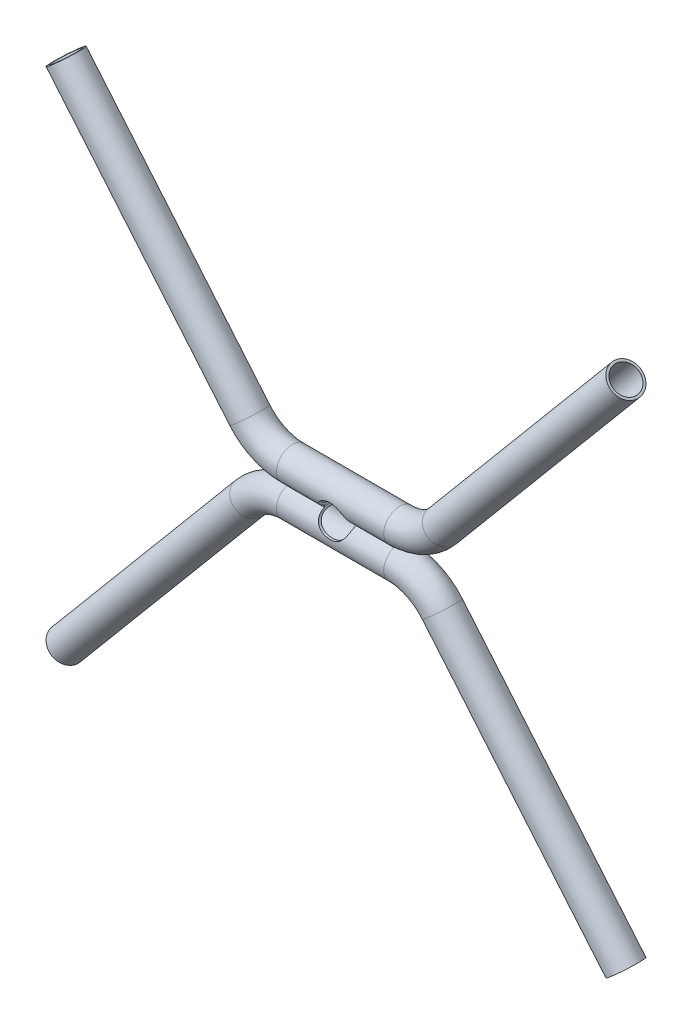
ISO-10303-21;
HEADER;
FILE_DESCRIPTION(('STEP AP214'),'2;1');
FILE_NAME('part.step','',(''),(''),'','','');
FILE_SCHEMA(('AUTOMOTIVE_DESIGN { 1 0 10303 214 1 1 1 1 }'));
ENDSEC;
DATA;
#1=APPLICATION_CONTEXT('core data for automotive mechanical design processes');
#2=APPLICATION_PROTOCOL_DEFINITION('international standard','automotive_design',2000,#1);
#3=PRODUCT_CONTEXT('',#1,'mechanical');
#4=PRODUCT('Part','Part','',(#3));
#5=PRODUCT_RELATED_PRODUCT_CATEGORY('part','',(#4));
#6=PRODUCT_DEFINITION_FORMATION('','',#4);
#7=PRODUCT_DEFINITION_CONTEXT('part definition',#1,'design');
#8=PRODUCT_DEFINITION('design','',#6,#7);
#9=PRODUCT_DEFINITION_SHAPE('','',#8);
#10=(LENGTH_UNIT() NAMED_UNIT(*) SI_UNIT(.MILLI.,.METRE.));
#11=(NAMED_UNIT(*) PLANE_ANGLE_UNIT() SI_UNIT($,.RADIAN.));
#12=(NAMED_UNIT(*) SI_UNIT($,.STERADIAN.) SOLID_ANGLE_UNIT());
#13=UNCERTAINTY_MEASURE_WITH_UNIT(LENGTH_MEASURE(1.E-05),#10,'distance_accuracy_value','');
#14=(GEOMETRIC_REPRESENTATION_CONTEXT(3) GLOBAL_UNCERTAINTY_ASSIGNED_CONTEXT((#13)) GLOBAL_UNIT_ASSIGNED_CONTEXT((#10,
#11,#12)) REPRESENTATION_CONTEXT('',''));
#15=CARTESIAN_POINT('',(0.,0.,0.));
#16=DIRECTION('',(0.,0.,1.));
#17=DIRECTION('',(1.,0.,0.));
#18=AXIS2_PLACEMENT_3D('',#15,#16,#17);
#19=CARTESIAN_POINT('',(-33.679231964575,10.6603625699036,-3.57647503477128));
#20=DIRECTION('',(0.,0.,-1.));
#21=DIRECTION('',(-1.,0.,0.));
#22=AXIS2_PLACEMENT_3D('',#19,#20,#21);
#23=PLANE('',#22);
#24=DIRECTION('',(1.,0.,0.));
#25=VECTOR('',#24,1.);
#26=CARTESIAN_POINT('',(-33.679231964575,9.33963743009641,-3.57647503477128));
#27=LINE('',#26,#25);
#28=CARTESIAN_POINT('',(9.97817224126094,9.33963743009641,-3.57647503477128));
#29=VERTEX_POINT('',#28);
#30=CARTESIAN_POINT('',(33.679231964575,9.33963743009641,-3.57647503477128));
#31=VERTEX_POINT('',#30);
#32=EDGE_CURVE('E81',#29,#31,#27,.T.);
#33=ORIENTED_EDGE('',*,*,#32,.F.);
#34=CARTESIAN_POINT('',(0.,10.,-3.57647503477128));
#35=DIRECTION('',(0.,0.,-1.));
#36=DIRECTION('',(-1.,0.,0.));
#37=AXIS2_PLACEMENT_3D('',#34,#35,#36);
#38=CIRCLE('',#37,10.);
#39=CARTESIAN_POINT('',(9.97817224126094,10.6603625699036,-3.57647503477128));
#40=VERTEX_POINT('',#39);
#41=EDGE_CURVE('E63',#29,#40,#38,.F.);
#42=ORIENTED_EDGE('',*,*,#41,.T.);
#43=DIRECTION('',(1.,0.,0.));
#44=VECTOR('',#43,1.);
#45=CARTESIAN_POINT('',(-33.679231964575,10.6603625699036,-3.57647503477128));
#46=LINE('',#45,#44);
#47=CARTESIAN_POINT('',(33.679231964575,10.6603625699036,-3.57647503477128));
#48=VERTEX_POINT('',#47);
#49=EDGE_CURVE('E89',#48,#40,#46,.F.);
#50=ORIENTED_EDGE('',*,*,#49,.F.);
#51=CARTESIAN_POINT('',(33.679231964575,10.6603625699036,-3.57647503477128));
#52=DIRECTION('',(0.,-1.,0.));
#53=VECTOR('',#52,1.);
#54=LINE('',#51,#53);
#55=EDGE_CURVE('E94',#48,#31,#54,.T.);
#56=ORIENTED_EDGE('',*,*,#55,.T.);
#57=EDGE_LOOP('',(#33,#42,#50,#56));
#58=FACE_BOUND('',#57,.T.);
#59=ADVANCED_FACE('F45',(#58),#23,.T.);
#60=CARTESIAN_POINT('',(-33.679231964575,0.,0.));
#61=DIRECTION('',(1.,0.,0.));
#62=DIRECTION('',(0.,1.,0.));
#63=AXIS2_PLACEMENT_3D('',#60,#61,#62);
#64=CYLINDRICAL_SURFACE('',#63,10.001);
#65=DIRECTION('',(-1.,0.,0.));
#66=VECTOR('',#65,1.);
#67=CARTESIAN_POINT('',(-33.679231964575,10.,-0.141424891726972));
#68=LINE('',#67,#66);
#69=CARTESIAN_POINT('',(33.6792319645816,10.,-0.141424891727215));
#70=VERTEX_POINT('',#69);
#71=CARTESIAN_POINT('',(10.,10.,-0.141424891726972));
#72=VERTEX_POINT('',#71);
#73=EDGE_CURVE('E82',#70,#72,#68,.T.);
#74=ORIENTED_EDGE('',*,*,#73,.T.);
#75=CARTESIAN_POINT('',(10.,10.,-0.141424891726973));
#76=CARTESIAN_POINT('',(9.99999490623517,9.99792032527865,-0.288494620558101));
#77=CARTESIAN_POINT('',(9.99999994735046,9.99259555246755,-0.4355008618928));
#78=CARTESIAN_POINT('',(9.99997455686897,9.97546965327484,-0.729134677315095));
#79=CARTESIAN_POINT('',(9.99994412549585,9.96366856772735,-0.875762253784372));
#80=CARTESIAN_POINT('',(9.99971721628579,9.91880985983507,-1.3123822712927));
#81=CARTESIAN_POINT('',(9.99938679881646,9.8762625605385,-1.60145181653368));
#82=CARTESIAN_POINT('',(9.99741433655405,9.76604433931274,-2.17476105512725));
#83=CARTESIAN_POINT('',(9.99577228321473,9.69837325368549,-2.45900071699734));
#84=CARTESIAN_POINT('',(9.99117821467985,9.57814455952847,-2.88111013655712));
#85=CARTESIAN_POINT('',(9.98927992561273,9.53473907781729,-3.02165123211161));
#86=CARTESIAN_POINT('',(9.98451502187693,9.44177892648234,-3.30067179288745));
#87=CARTESIAN_POINT('',(9.98164838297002,9.39222410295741,-3.43915120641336));
#88=CARTESIAN_POINT('',(9.97817224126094,9.33963743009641,-3.57647503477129));
#89=B_SPLINE_CURVE_WITH_KNOTS('',3,(#75,#76,#77,#78,#79,#80,#81,#82,#83,#84,#85,#86,#87,#88),
.UNSPECIFIED.,.F.,.F.,(4,2,2,2,2,2,4),(0.,0.441182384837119,0.88236198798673,1.75772579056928,
2.63309529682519,3.07427746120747,3.51547066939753),.UNSPECIFIED.);
#90=EDGE_CURVE('E76',#72,#29,#89,.T.);
#91=ORIENTED_EDGE('',*,*,#90,.T.);
#92=ORIENTED_EDGE('',*,*,#32,.T.);
#93=CARTESIAN_POINT('',(33.679231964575,0.,0.));
#94=DIRECTION('',(-1.,0.,0.));
#95=DIRECTION('',(0.,-1.,0.));
#96=AXIS2_PLACEMENT_3D('',#93,#94,#95);
#97=CIRCLE('',#96,10.001);
#98=EDGE_CURVE('E93',#31,#70,#97,.F.);
#99=ORIENTED_EDGE('',*,*,#98,.T.);
#100=EDGE_LOOP('',(#74,#91,#92,#99));
#101=FACE_BOUND('',#100,.T.);
#102=ADVANCED_FACE('F91',(#101),#64,.F.);
#103=CARTESIAN_POINT('',(-33.679231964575,20.,0.));
#104=DIRECTION('',(1.,0.,0.));
#105=DIRECTION('',(0.,-1.,0.));
#106=AXIS2_PLACEMENT_3D('',#103,#104,#105);
#107=CYLINDRICAL_SURFACE('',#106,10.001);
#108=ORIENTED_EDGE('',*,*,#49,.T.);
#109=CARTESIAN_POINT('',(9.97817224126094,10.6603625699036,-3.57647503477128));
#110=CARTESIAN_POINT('',(9.98164838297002,10.6077758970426,-3.43915120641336));
#111=CARTESIAN_POINT('',(9.98451502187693,10.5582210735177,-3.30067179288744));
#112=CARTESIAN_POINT('',(9.98927992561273,10.4652609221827,-3.02165123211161));
#113=CARTESIAN_POINT('',(9.99117821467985,10.4218554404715,-2.88111013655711));
#114=CARTESIAN_POINT('',(9.99577228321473,10.3016267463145,-2.45900071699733));
#115=CARTESIAN_POINT('',(9.99741433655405,10.2339556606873,-2.17476105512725));
#116=CARTESIAN_POINT('',(9.99938679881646,10.1237374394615,-1.60145181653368));
#117=CARTESIAN_POINT('',(9.99971721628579,10.0811901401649,-1.3123822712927));
#118=CARTESIAN_POINT('',(9.99994412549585,10.0363314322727,-0.87576225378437));
#119=CARTESIAN_POINT('',(9.99997455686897,10.0245303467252,-0.729134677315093));
#120=CARTESIAN_POINT('',(9.99999994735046,10.0074044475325,-0.435500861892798));
#121=CARTESIAN_POINT('',(9.99999490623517,10.0020796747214,-0.288494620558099));
#122=CARTESIAN_POINT('',(10.,10.,-0.141424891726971));
#123=B_SPLINE_CURVE_WITH_KNOTS('',3,(#109,#110,#111,#112,#113,#114,#115,#116,#117,#118,#119,
#120,#121,#122),.UNSPECIFIED.,.F.,.F.,(4,2,2,2,2,2,4),(0.,0.441193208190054,0.882375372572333,
1.75774487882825,2.6331086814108,3.07428828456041,3.51547066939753),.UNSPECIFIED.);
#124=EDGE_CURVE('E56',#40,#72,#123,.T.);
#125=ORIENTED_EDGE('',*,*,#124,.T.);
#126=ORIENTED_EDGE('',*,*,#73,.F.);
#127=CARTESIAN_POINT('',(33.679231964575,20.,0.));
#128=DIRECTION('',(1.,0.,0.));
#129=DIRECTION('',(0.,1.,0.));
#130=AXIS2_PLACEMENT_3D('',#127,#128,#129);
#131=CIRCLE('',#130,10.001);
#132=EDGE_CURVE('E13',#48,#70,#131,.F.);
#133=ORIENTED_EDGE('',*,*,#132,.F.);
#134=EDGE_LOOP('',(#108,#125,#126,#133));
#135=FACE_BOUND('',#134,.T.);
#136=ADVANCED_FACE('F87',(#135),#107,.F.);
#137=CARTESIAN_POINT('',(33.679231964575,0.,0.));
#138=DIRECTION('',(1.,0.,0.));
#139=DIRECTION('',(0.,1.,0.));
#140=AXIS2_PLACEMENT_3D('',#137,#138,#139);
#141=PLANE('',#140);
#142=ORIENTED_EDGE('',*,*,#55,.F.);
#143=ORIENTED_EDGE('',*,*,#132,.T.);
#144=ORIENTED_EDGE('',*,*,#98,.F.);
#145=EDGE_LOOP('',(#142,#143,#144));
#146=FACE_BOUND('',#145,.T.);
#147=ADVANCED_FACE('F114',(#146),#141,.T.);
#148=CARTESIAN_POINT('',(0.,10.,-10.));
#149=DIRECTION('',(0.,0.,1.));
#150=DIRECTION('',(1.,0.,0.));
#151=AXIS2_PLACEMENT_3D('',#148,#149,#150);
#152=CYLINDRICAL_SURFACE('',#151,10.);
#153=ORIENTED_EDGE('',*,*,#90,.F.);
#154=ORIENTED_EDGE('',*,*,#124,.F.);
#155=ORIENTED_EDGE('',*,*,#41,.F.);
#156=EDGE_LOOP('',(#153,#154,#155));
#157=FACE_BOUND('',#156,.T.);
#158=ADVANCED_FACE('F47',(#157),#152,.F.);
#159=CLOSED_SHELL('',(#59,#102,#136,#147,#158));
#160=MANIFOLD_SOLID_BREP('B2',#159);
#161=CARTESIAN_POINT('',(-33.679231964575,0.,0.));
#162=DIRECTION('',(1.,0.,0.));
#163=DIRECTION('',(0.,1.,0.));
#164=AXIS2_PLACEMENT_3D('',#161,#162,#163);
#165=CYLINDRICAL_SURFACE('',#164,10.001);
#166=DIRECTION('',(1.,0.,0.));
#167=VECTOR('',#166,1.);
#168=CARTESIAN_POINT('',(-33.679231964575,9.33963743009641,3.57647503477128));
#169=LINE('',#168,#167);
#170=CARTESIAN_POINT('',(33.679231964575,9.3396374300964,3.57647503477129));
#171=VERTEX_POINT('',#170);
#172=CARTESIAN_POINT('',(9.97817224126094,9.3396374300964,3.57647503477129));
#173=VERTEX_POINT('',#172);
#174=EDGE_CURVE('E244',#171,#173,#169,.F.);
#175=ORIENTED_EDGE('',*,*,#174,.T.);
#176=CARTESIAN_POINT('',(9.97817224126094,9.3396374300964,3.57647503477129));
#177=CARTESIAN_POINT('',(9.98164838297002,9.39222410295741,3.43915120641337));
#178=CARTESIAN_POINT('',(9.98451502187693,9.44177892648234,3.30067179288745));
#179=CARTESIAN_POINT('',(9.98927992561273,9.53473907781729,3.02165123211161));
#180=CARTESIAN_POINT('',(9.99117821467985,9.57814455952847,2.88111013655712));
#181=CARTESIAN_POINT('',(9.99577228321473,9.69837325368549,2.45900071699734));
#182=CARTESIAN_POINT('',(9.99741433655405,9.76604433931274,2.17476105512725));
#183=CARTESIAN_POINT('',(9.99938679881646,9.8762625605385,1.60145181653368));
#184=CARTESIAN_POINT('',(9.99971721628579,9.91880985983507,1.3123822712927));
#185=CARTESIAN_POINT('',(9.99994412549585,9.96366856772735,0.875762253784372));
#186=CARTESIAN_POINT('',(9.99997455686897,9.97546965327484,0.729134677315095));
#187=CARTESIAN_POINT('',(9.99999994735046,9.99259555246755,0.435500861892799));
#188=CARTESIAN_POINT('',(9.99999490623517,9.99792032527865,0.2884946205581));
#189=CARTESIAN_POINT('',(10.,10.,0.141424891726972));
#190=B_SPLINE_CURVE_WITH_KNOTS('',3,(#176,#177,#178,#179,#180,#181,#182,#183,#184,#185,#186,
#187,#188,#189),.UNSPECIFIED.,.F.,.F.,(4,2,2,2,2,2,4),(0.,0.441193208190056,0.882375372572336,
1.75774487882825,2.6331086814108,3.07428828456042,3.51547066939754),.UNSPECIFIED.);
#191=CARTESIAN_POINT('',(10.,10.,0.141424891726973));
#192=VERTEX_POINT('',#191);
#193=EDGE_CURVE('E232',#173,#192,#190,.T.);
#194=ORIENTED_EDGE('',*,*,#193,.T.);
#195=DIRECTION('',(1.,0.,0.));
#196=VECTOR('',#195,1.);
#197=CARTESIAN_POINT('',(-33.679231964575,10.,0.141424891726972));
#198=LINE('',#197,#196);
#199=CARTESIAN_POINT('',(33.679231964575,10.,0.141424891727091));
#200=VERTEX_POINT('',#199);
#201=EDGE_CURVE('E241',#192,#200,#198,.T.);
#202=ORIENTED_EDGE('',*,*,#201,.T.);
#203=CARTESIAN_POINT('',(33.679231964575,0.,0.));
#204=DIRECTION('',(-1.,0.,0.));
#205=DIRECTION('',(0.,-1.,0.));
#206=AXIS2_PLACEMENT_3D('',#203,#204,#205);
#207=CIRCLE('',#206,10.001);
#208=EDGE_CURVE('E237',#200,#171,#207,.F.);
#209=ORIENTED_EDGE('',*,*,#208,.T.);
#210=EDGE_LOOP('',(#175,#194,#202,#209));
#211=FACE_BOUND('',#210,.T.);
#212=ADVANCED_FACE('F195',(#211),#165,.F.);
#213=CARTESIAN_POINT('',(-33.679231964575,20.,0.));
#214=DIRECTION('',(1.,0.,0.));
#215=DIRECTION('',(0.,-1.,0.));
#216=AXIS2_PLACEMENT_3D('',#213,#214,#215);
#217=CYLINDRICAL_SURFACE('',#216,10.001);
#218=ORIENTED_EDGE('',*,*,#201,.F.);
#219=CARTESIAN_POINT('',(10.,10.,0.141424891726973));
#220=CARTESIAN_POINT('',(9.99999490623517,10.0020796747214,0.288494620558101));
#221=CARTESIAN_POINT('',(9.99999994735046,10.0074044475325,0.4355008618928));
#222=CARTESIAN_POINT('',(9.99997455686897,10.0245303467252,0.729134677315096));
#223=CARTESIAN_POINT('',(9.99994412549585,10.0363314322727,0.875762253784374));
#224=CARTESIAN_POINT('',(9.99971721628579,10.0811901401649,1.31238227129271));
#225=CARTESIAN_POINT('',(9.99938679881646,10.1237374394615,1.60145181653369));
#226=CARTESIAN_POINT('',(9.99741433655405,10.2339556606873,2.17476105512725));
#227=CARTESIAN_POINT('',(9.99577228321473,10.3016267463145,2.45900071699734));
#228=CARTESIAN_POINT('',(9.99117821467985,10.4218554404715,2.88111013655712));
#229=CARTESIAN_POINT('',(9.98927992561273,10.4652609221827,3.02165123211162));
#230=CARTESIAN_POINT('',(9.98451502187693,10.5582210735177,3.30067179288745));
#231=CARTESIAN_POINT('',(9.98164838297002,10.6077758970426,3.43915120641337));
#232=CARTESIAN_POINT('',(9.97817224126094,10.6603625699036,3.57647503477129));
#233=B_SPLINE_CURVE_WITH_KNOTS('',3,(#219,#220,#221,#222,#223,#224,#225,#226,#227,#228,#229,
#230,#231,#232),.UNSPECIFIED.,.F.,.F.,(4,2,2,2,2,2,4),(0.,0.44118238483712,0.882361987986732,
1.75772579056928,2.6330952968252,3.07427746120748,3.51547066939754),.UNSPECIFIED.);
#234=CARTESIAN_POINT('',(9.97817224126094,10.6603625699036,3.57647503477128));
#235=VERTEX_POINT('',#234);
#236=EDGE_CURVE('E230',#192,#235,#233,.T.);
#237=ORIENTED_EDGE('',*,*,#236,.T.);
#238=DIRECTION('',(1.,0.,0.));
#239=VECTOR('',#238,1.);
#240=CARTESIAN_POINT('',(-33.679231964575,10.6603625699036,3.57647503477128));
#241=LINE('',#240,#239);
#242=CARTESIAN_POINT('',(33.679231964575,10.6603625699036,3.57647503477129));
#243=VERTEX_POINT('',#242);
#244=EDGE_CURVE('E236',#235,#243,#241,.T.);
#245=ORIENTED_EDGE('',*,*,#244,.T.);
#246=CARTESIAN_POINT('',(33.679231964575,20.,0.));
#247=DIRECTION('',(1.,0.,0.));
#248=DIRECTION('',(0.,1.,0.));
#249=AXIS2_PLACEMENT_3D('',#246,#247,#248);
#250=CIRCLE('',#249,10.001);
#251=EDGE_CURVE('E247',#200,#243,#250,.F.);
#252=ORIENTED_EDGE('',*,*,#251,.F.);
#253=EDGE_LOOP('',(#218,#237,#245,#252));
#254=FACE_BOUND('',#253,.T.);
#255=ADVANCED_FACE('F246',(#254),#217,.F.);
#256=CARTESIAN_POINT('',(33.679231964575,0.,0.));
#257=DIRECTION('',(1.,0.,0.));
#258=DIRECTION('',(0.,1.,0.));
#259=AXIS2_PLACEMENT_3D('',#256,#257,#258);
#260=PLANE('',#259);
#261=ORIENTED_EDGE('',*,*,#208,.F.);
#262=ORIENTED_EDGE('',*,*,#251,.T.);
#263=CARTESIAN_POINT('',(33.679231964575,10.6603625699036,3.57647503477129));
#264=DIRECTION('',(0.,-1.,0.));
#265=VECTOR('',#264,1.);
#266=LINE('',#263,#265);
#267=EDGE_CURVE('E206',#243,#171,#266,.T.);
#268=ORIENTED_EDGE('',*,*,#267,.T.);
#269=EDGE_LOOP('',(#261,#262,#268));
#270=FACE_BOUND('',#269,.T.);
#271=ADVANCED_FACE('F272',(#270),#260,.T.);
#272=CARTESIAN_POINT('',(-33.679231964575,10.6603625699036,3.57647503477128));
#273=DIRECTION('',(0.,0.,1.));
#274=DIRECTION('',(1.,0.,0.));
#275=AXIS2_PLACEMENT_3D('',#272,#273,#274);
#276=PLANE('',#275);
#277=ORIENTED_EDGE('',*,*,#244,.F.);
#278=CARTESIAN_POINT('',(0.,10.,3.57647503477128));
#279=DIRECTION('',(0.,0.,1.));
#280=DIRECTION('',(1.,0.,0.));
#281=AXIS2_PLACEMENT_3D('',#278,#279,#280);
#282=CIRCLE('',#281,10.);
#283=EDGE_CURVE('E43',#235,#173,#282,.F.);
#284=ORIENTED_EDGE('',*,*,#283,.T.);
#285=ORIENTED_EDGE('',*,*,#174,.F.);
#286=ORIENTED_EDGE('',*,*,#267,.F.);
#287=EDGE_LOOP('',(#277,#284,#285,#286));
#288=FACE_BOUND('',#287,.T.);
#289=ADVANCED_FACE('F280',(#288),#276,.T.);
#290=CARTESIAN_POINT('',(0.,10.,-10.));
#291=DIRECTION('',(0.,0.,1.));
#292=DIRECTION('',(1.,0.,0.));
#293=AXIS2_PLACEMENT_3D('',#290,#291,#292);
#294=CYLINDRICAL_SURFACE('',#293,10.);
#295=ORIENTED_EDGE('',*,*,#236,.F.);
#296=ORIENTED_EDGE('',*,*,#193,.F.);
#297=ORIENTED_EDGE('',*,*,#283,.F.);
#298=EDGE_LOOP('',(#295,#296,#297));
#299=FACE_BOUND('',#298,.T.);
#300=ADVANCED_FACE('F197',(#299),#294,.F.);
#301=CLOSED_SHELL('',(#212,#255,#271,#289,#300));
#302=MANIFOLD_SOLID_BREP('B7',#301);
#303=CARTESIAN_POINT('',(-33.679231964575,20.,0.));
#304=DIRECTION('',(-1.,0.,0.));
#305=DIRECTION('',(0.,-1.,0.));
#306=AXIS2_PLACEMENT_3D('',#303,#304,#305);
#307=PLANE('',#306);
#308=CARTESIAN_POINT('',(-33.679231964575,9.33963743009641,-3.57647503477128));
#309=DIRECTION('',(0.,1.,0.));
#310=VECTOR('',#309,1.);
#311=LINE('',#308,#310);
#312=CARTESIAN_POINT('',(-33.679231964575,9.3396374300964,-3.57647503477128));
#313=VERTEX_POINT('',#312);
#314=CARTESIAN_POINT('',(-33.679231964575,10.6603625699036,-3.57647503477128));
#315=VERTEX_POINT('',#314);
#316=EDGE_CURVE('E396',#313,#315,#311,.T.);
#317=ORIENTED_EDGE('',*,*,#316,.F.);
#318=CARTESIAN_POINT('',(-33.679231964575,0.,0.));
#319=DIRECTION('',(1.,0.,0.));
#320=DIRECTION('',(0.,1.,0.));
#321=AXIS2_PLACEMENT_3D('',#318,#319,#320);
#322=CIRCLE('',#321,10.001);
#323=CARTESIAN_POINT('',(-33.679231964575,10.,-0.141424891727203));
#324=VERTEX_POINT('',#323);
#325=EDGE_CURVE('E372',#313,#324,#322,.T.);
#326=ORIENTED_EDGE('',*,*,#325,.T.);
#327=CARTESIAN_POINT('',(-33.679231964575,20.,0.));
#328=DIRECTION('',(-1.,0.,0.));
#329=DIRECTION('',(0.,-1.,0.));
#330=AXIS2_PLACEMENT_3D('',#327,#328,#329);
#331=CIRCLE('',#330,10.001);
#332=EDGE_CURVE('E395',#315,#324,#331,.T.);
#333=ORIENTED_EDGE('',*,*,#332,.F.);
#334=EDGE_LOOP('',(#317,#326,#333));
#335=FACE_BOUND('',#334,.T.);
#336=ADVANCED_FACE('F345',(#335),#307,.T.);
#337=CARTESIAN_POINT('',(-33.679231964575,20.,0.));
#338=DIRECTION('',(1.,0.,0.));
#339=DIRECTION('',(0.,-1.,0.));
#340=AXIS2_PLACEMENT_3D('',#337,#338,#339);
#341=CYLINDRICAL_SURFACE('',#340,10.001);
#342=DIRECTION('',(-1.,0.,0.));
#343=VECTOR('',#342,1.);
#344=CARTESIAN_POINT('',(-33.679231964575,10.,-0.141424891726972));
#345=LINE('',#344,#343);
#346=CARTESIAN_POINT('',(-10.,10.,-0.141424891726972));
#347=VERTEX_POINT('',#346);
#348=EDGE_CURVE('E389',#347,#324,#345,.T.);
#349=ORIENTED_EDGE('',*,*,#348,.F.);
#350=CARTESIAN_POINT('',(-10.,10.,-0.141424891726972));
#351=CARTESIAN_POINT('',(-9.99999490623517,10.0020796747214,-0.288494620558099));
#352=CARTESIAN_POINT('',(-9.99999994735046,10.0074044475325,-0.435500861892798));
#353=CARTESIAN_POINT('',(-9.99997455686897,10.0245303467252,-0.729134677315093));
#354=CARTESIAN_POINT('',(-9.99994412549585,10.0363314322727,-0.87576225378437));
#355=CARTESIAN_POINT('',(-9.99971721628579,10.0811901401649,-1.3123822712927));
#356=CARTESIAN_POINT('',(-9.99938679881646,10.1237374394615,-1.60145181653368));
#357=CARTESIAN_POINT('',(-9.99741433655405,10.2339556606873,-2.17476105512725));
#358=CARTESIAN_POINT('',(-9.99577228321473,10.3016267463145,-2.45900071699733));
#359=CARTESIAN_POINT('',(-9.99117821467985,10.4218554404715,-2.88111013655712));
#360=CARTESIAN_POINT('',(-9.98927992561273,10.4652609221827,-3.02165123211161));
#361=CARTESIAN_POINT('',(-9.98451502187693,10.5582210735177,-3.30067179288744));
#362=CARTESIAN_POINT('',(-9.98164838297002,10.6077758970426,-3.43915120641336));
#363=CARTESIAN_POINT('',(-9.97817224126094,10.6603625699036,-3.57647503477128));
#364=B_SPLINE_CURVE_WITH_KNOTS('',3,(#350,#351,#352,#353,#354,#355,#356,#357,#358,#359,#360,
#361,#362,#363),.UNSPECIFIED.,.F.,.F.,(4,2,2,2,2,2,4),(0.,0.441182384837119,0.88236198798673,
1.75772579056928,2.63309529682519,3.07427746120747,3.51547066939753),.UNSPECIFIED.);
#365=CARTESIAN_POINT('',(-9.97817224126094,10.6603625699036,-3.57647503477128));
#366=VERTEX_POINT('',#365);
#367=EDGE_CURVE('E193',#347,#366,#364,.T.);
#368=ORIENTED_EDGE('',*,*,#367,.T.);
#369=DIRECTION('',(1.,0.,0.));
#370=VECTOR('',#369,1.);
#371=CARTESIAN_POINT('',(-33.679231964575,10.6603625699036,-3.57647503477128));
#372=LINE('',#371,#370);
#373=EDGE_CURVE('E399',#366,#315,#372,.F.);
#374=ORIENTED_EDGE('',*,*,#373,.T.);
#375=ORIENTED_EDGE('',*,*,#332,.T.);
#376=EDGE_LOOP('',(#349,#368,#374,#375));
#377=FACE_BOUND('',#376,.T.);
#378=ADVANCED_FACE('F393',(#377),#341,.F.);
#379=CARTESIAN_POINT('',(-33.679231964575,0.,0.));
#380=DIRECTION('',(1.,0.,0.));
#381=DIRECTION('',(0.,1.,0.));
#382=AXIS2_PLACEMENT_3D('',#379,#380,#381);
#383=CYLINDRICAL_SURFACE('',#382,10.001);
#384=DIRECTION('',(1.,0.,0.));
#385=VECTOR('',#384,1.);
#386=CARTESIAN_POINT('',(-33.679231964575,9.33963743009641,-3.57647503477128));
#387=LINE('',#386,#385);
#388=CARTESIAN_POINT('',(-9.97817224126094,9.33963743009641,-3.57647503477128));
#389=VERTEX_POINT('',#388);
#390=EDGE_CURVE('E358',#313,#389,#387,.T.);
#391=ORIENTED_EDGE('',*,*,#390,.T.);
#392=CARTESIAN_POINT('',(-9.97817224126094,9.33963743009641,-3.57647503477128));
#393=CARTESIAN_POINT('',(-9.98164838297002,9.39222410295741,-3.43915120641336));
#394=CARTESIAN_POINT('',(-9.98451502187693,9.44177892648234,-3.30067179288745));
#395=CARTESIAN_POINT('',(-9.98927992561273,9.53473907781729,-3.02165123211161));
#396=CARTESIAN_POINT('',(-9.99117821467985,9.57814455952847,-2.88111013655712));
#397=CARTESIAN_POINT('',(-9.99577228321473,9.6983732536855,-2.45900071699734));
#398=CARTESIAN_POINT('',(-9.99741433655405,9.76604433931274,-2.17476105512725));
#399=CARTESIAN_POINT('',(-9.99938679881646,9.8762625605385,-1.60145181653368));
#400=CARTESIAN_POINT('',(-9.99971721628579,9.91880985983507,-1.3123822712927));
#401=CARTESIAN_POINT('',(-9.99994412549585,9.96366856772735,-0.875762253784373));
#402=CARTESIAN_POINT('',(-9.99997455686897,9.97546965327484,-0.729134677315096));
#403=CARTESIAN_POINT('',(-9.99999994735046,9.99259555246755,-0.435500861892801));
#404=CARTESIAN_POINT('',(-9.99999490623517,9.99792032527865,-0.288494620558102));
#405=CARTESIAN_POINT('',(-10.,10.,-0.141424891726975));
#406=B_SPLINE_CURVE_WITH_KNOTS('',3,(#392,#393,#394,#395,#396,#397,#398,#399,#400,#401,#402,
#403,#404,#405),.UNSPECIFIED.,.F.,.F.,(4,2,2,2,2,2,4),(0.,0.441193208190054,0.882375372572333,
1.75774487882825,2.6331086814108,3.07428828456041,3.51547066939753),.UNSPECIFIED.);
#407=EDGE_CURVE('E384',#389,#347,#406,.T.);
#408=ORIENTED_EDGE('',*,*,#407,.T.);
#409=ORIENTED_EDGE('',*,*,#348,.T.);
#410=ORIENTED_EDGE('',*,*,#325,.F.);
#411=EDGE_LOOP('',(#391,#408,#409,#410));
#412=FACE_BOUND('',#411,.T.);
#413=ADVANCED_FACE('F388',(#412),#383,.F.);
#414=CARTESIAN_POINT('',(-33.679231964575,10.6603625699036,-3.57647503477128));
#415=DIRECTION('',(0.,0.,-1.));
#416=DIRECTION('',(-1.,0.,0.));
#417=AXIS2_PLACEMENT_3D('',#414,#415,#416);
#418=PLANE('',#417);
#419=ORIENTED_EDGE('',*,*,#373,.F.);
#420=CARTESIAN_POINT('',(0.,10.,-3.57647503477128));
#421=DIRECTION('',(0.,0.,-1.));
#422=DIRECTION('',(-1.,0.,0.));
#423=AXIS2_PLACEMENT_3D('',#420,#421,#422);
#424=CIRCLE('',#423,10.);
#425=EDGE_CURVE('E365',#366,#389,#424,.F.);
#426=ORIENTED_EDGE('',*,*,#425,.T.);
#427=ORIENTED_EDGE('',*,*,#390,.F.);
#428=ORIENTED_EDGE('',*,*,#316,.T.);
#429=EDGE_LOOP('',(#419,#426,#427,#428));
#430=FACE_BOUND('',#429,.T.);
#431=ADVANCED_FACE('F424',(#430),#418,.T.);
#432=CARTESIAN_POINT('',(0.,10.,-10.));
#433=DIRECTION('',(0.,0.,1.));
#434=DIRECTION('',(1.,0.,0.));
#435=AXIS2_PLACEMENT_3D('',#432,#433,#434);
#436=CYLINDRICAL_SURFACE('',#435,10.);
#437=ORIENTED_EDGE('',*,*,#367,.F.);
#438=ORIENTED_EDGE('',*,*,#407,.F.);
#439=ORIENTED_EDGE('',*,*,#425,.F.);
#440=EDGE_LOOP('',(#437,#438,#439));
#441=FACE_BOUND('',#440,.T.);
#442=ADVANCED_FACE('F383',(#441),#436,.F.);
#443=CLOSED_SHELL('',(#336,#378,#413,#431,#442));
#444=MANIFOLD_SOLID_BREP('B37',#443);
#445=CARTESIAN_POINT('',(-33.679231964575,0.,0.));
#446=DIRECTION('',(1.,0.,0.));
#447=DIRECTION('',(0.,1.,0.));
#448=AXIS2_PLACEMENT_3D('',#445,#446,#447);
#449=PLANE('',#448);
#450=CARTESIAN_POINT('',(-33.679231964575,0.,0.));
#451=DIRECTION('',(1.,0.,0.));
#452=DIRECTION('',(0.,1.,0.));
#453=AXIS2_PLACEMENT_3D('',#450,#451,#452);
#454=CIRCLE('',#453,10.001);
#455=CARTESIAN_POINT('',(-33.6792319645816,10.,0.141424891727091));
#456=VERTEX_POINT('',#455);
#457=CARTESIAN_POINT('',(-33.679231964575,9.3396374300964,3.57647503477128));
#458=VERTEX_POINT('',#457);
#459=EDGE_CURVE('E503',#456,#458,#454,.T.);
#460=ORIENTED_EDGE('',*,*,#459,.T.);
#461=CARTESIAN_POINT('',(-33.679231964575,9.3396374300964,3.57647503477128));
#462=DIRECTION('',(0.,1.,0.));
#463=VECTOR('',#462,1.);
#464=LINE('',#461,#463);
#465=CARTESIAN_POINT('',(-33.679231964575,10.6603625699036,3.57647503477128));
#466=VERTEX_POINT('',#465);
#467=EDGE_CURVE('E543',#458,#466,#464,.T.);
#468=ORIENTED_EDGE('',*,*,#467,.T.);
#469=CARTESIAN_POINT('',(-33.679231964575,20.,0.));
#470=DIRECTION('',(-1.,0.,0.));
#471=DIRECTION('',(0.,-1.,0.));
#472=AXIS2_PLACEMENT_3D('',#469,#470,#471);
#473=CIRCLE('',#472,10.001);
#474=EDGE_CURVE('E537',#456,#466,#473,.T.);
#475=ORIENTED_EDGE('',*,*,#474,.F.);
#476=EDGE_LOOP('',(#460,#468,#475));
#477=FACE_BOUND('',#476,.T.);
#478=ADVANCED_FACE('F493',(#477),#449,.F.);
#479=CARTESIAN_POINT('',(-33.679231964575,20.,0.));
#480=DIRECTION('',(1.,0.,0.));
#481=DIRECTION('',(0.,-1.,0.));
#482=AXIS2_PLACEMENT_3D('',#479,#480,#481);
#483=CYLINDRICAL_SURFACE('',#482,10.001);
#484=DIRECTION('',(1.,0.,0.));
#485=VECTOR('',#484,1.);
#486=CARTESIAN_POINT('',(-33.679231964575,10.6603625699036,3.57647503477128));
#487=LINE('',#486,#485);
#488=CARTESIAN_POINT('',(-9.97817224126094,10.6603625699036,3.57647503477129));
#489=VERTEX_POINT('',#488);
#490=EDGE_CURVE('E536',#466,#489,#487,.T.);
#491=ORIENTED_EDGE('',*,*,#490,.T.);
#492=CARTESIAN_POINT('',(-9.97817224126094,10.6603625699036,3.57647503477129));
#493=CARTESIAN_POINT('',(-9.98164838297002,10.6077758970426,3.43915120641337));
#494=CARTESIAN_POINT('',(-9.98451502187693,10.5582210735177,3.30067179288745));
#495=CARTESIAN_POINT('',(-9.98927992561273,10.4652609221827,3.02165123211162));
#496=CARTESIAN_POINT('',(-9.99117821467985,10.4218554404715,2.88111013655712));
#497=CARTESIAN_POINT('',(-9.99577228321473,10.3016267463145,2.45900071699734));
#498=CARTESIAN_POINT('',(-9.99741433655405,10.2339556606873,2.17476105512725));
#499=CARTESIAN_POINT('',(-9.99938679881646,10.1237374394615,1.60145181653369));
#500=CARTESIAN_POINT('',(-9.99971721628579,10.0811901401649,1.3123822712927));
#501=CARTESIAN_POINT('',(-9.99994412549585,10.0363314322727,0.875762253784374));
#502=CARTESIAN_POINT('',(-9.99997455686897,10.0245303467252,0.729134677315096));
#503=CARTESIAN_POINT('',(-9.99999994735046,10.0074044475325,0.435500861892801));
#504=CARTESIAN_POINT('',(-9.99999490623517,10.0020796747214,0.288494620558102));
#505=CARTESIAN_POINT('',(-10.,10.,0.141424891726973));
#506=B_SPLINE_CURVE_WITH_KNOTS('',3,(#492,#493,#494,#495,#496,#497,#498,#499,#500,#501,#502,
#503,#504,#505),.UNSPECIFIED.,.F.,.F.,(4,2,2,2,2,2,4),(0.,0.441193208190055,0.882375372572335,
1.75774487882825,2.6331086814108,3.07428828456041,3.51547066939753),.UNSPECIFIED.);
#507=CARTESIAN_POINT('',(-10.,10.,0.141424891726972));
#508=VERTEX_POINT('',#507);
#509=EDGE_CURVE('E343',#489,#508,#506,.T.);
#510=ORIENTED_EDGE('',*,*,#509,.T.);
#511=DIRECTION('',(1.,0.,0.));
#512=VECTOR('',#511,1.);
#513=CARTESIAN_POINT('',(-33.679231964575,10.,0.141424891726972));
#514=LINE('',#513,#512);
#515=EDGE_CURVE('E541',#456,#508,#514,.T.);
#516=ORIENTED_EDGE('',*,*,#515,.F.);
#517=ORIENTED_EDGE('',*,*,#474,.T.);
#518=EDGE_LOOP('',(#491,#510,#516,#517));
#519=FACE_BOUND('',#518,.T.);
#520=ADVANCED_FACE('F539',(#519),#483,.F.);
#521=CARTESIAN_POINT('',(-33.679231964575,0.,0.));
#522=DIRECTION('',(1.,0.,0.));
#523=DIRECTION('',(0.,1.,0.));
#524=AXIS2_PLACEMENT_3D('',#521,#522,#523);
#525=CYLINDRICAL_SURFACE('',#524,10.001);
#526=ORIENTED_EDGE('',*,*,#515,.T.);
#527=CARTESIAN_POINT('',(-10.,10.,0.141424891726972));
#528=CARTESIAN_POINT('',(-9.99999490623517,9.99792032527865,0.2884946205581));
#529=CARTESIAN_POINT('',(-9.99999994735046,9.99259555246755,0.435500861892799));
#530=CARTESIAN_POINT('',(-9.99997455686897,9.97546965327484,0.729134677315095));
#531=CARTESIAN_POINT('',(-9.99994412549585,9.96366856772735,0.875762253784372));
#532=CARTESIAN_POINT('',(-9.99971721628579,9.91880985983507,1.3123822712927));
#533=CARTESIAN_POINT('',(-9.99938679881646,9.8762625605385,1.60145181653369));
#534=CARTESIAN_POINT('',(-9.99741433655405,9.76604433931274,2.17476105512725));
#535=CARTESIAN_POINT('',(-9.99577228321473,9.69837325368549,2.45900071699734));
#536=CARTESIAN_POINT('',(-9.99117821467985,9.57814455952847,2.88111013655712));
#537=CARTESIAN_POINT('',(-9.98927992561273,9.53473907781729,3.02165123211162));
#538=CARTESIAN_POINT('',(-9.98451502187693,9.44177892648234,3.30067179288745));
#539=CARTESIAN_POINT('',(-9.98164838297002,9.39222410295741,3.43915120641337));
#540=CARTESIAN_POINT('',(-9.97817224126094,9.3396374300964,3.57647503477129));
#541=B_SPLINE_CURVE_WITH_KNOTS('',3,(#527,#528,#529,#530,#531,#532,#533,#534,#535,#536,#537,
#538,#539,#540),.UNSPECIFIED.,.F.,.F.,(4,2,2,2,2,2,4),(0.,0.44118238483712,0.882361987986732,
1.75772579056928,2.6330952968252,3.07427746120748,3.51547066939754),.UNSPECIFIED.);
#542=CARTESIAN_POINT('',(-9.97817224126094,9.3396374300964,3.57647503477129));
#543=VERTEX_POINT('',#542);
#544=EDGE_CURVE('E510',#508,#543,#541,.T.);
#545=ORIENTED_EDGE('',*,*,#544,.T.);
#546=DIRECTION('',(1.,0.,0.));
#547=VECTOR('',#546,1.);
#548=CARTESIAN_POINT('',(-33.679231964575,9.33963743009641,3.57647503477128));
#549=LINE('',#548,#547);
#550=EDGE_CURVE('E497',#543,#458,#549,.F.);
#551=ORIENTED_EDGE('',*,*,#550,.T.);
#552=ORIENTED_EDGE('',*,*,#459,.F.);
#553=EDGE_LOOP('',(#526,#545,#551,#552));
#554=FACE_BOUND('',#553,.T.);
#555=ADVANCED_FACE('F568',(#554),#525,.F.);
#556=CARTESIAN_POINT('',(-33.679231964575,10.6603625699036,3.57647503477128));
#557=DIRECTION('',(0.,0.,1.));
#558=DIRECTION('',(1.,0.,0.));
#559=AXIS2_PLACEMENT_3D('',#556,#557,#558);
#560=PLANE('',#559);
#561=ORIENTED_EDGE('',*,*,#550,.F.);
#562=CARTESIAN_POINT('',(0.,10.,3.57647503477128));
#563=DIRECTION('',(0.,0.,1.));
#564=DIRECTION('',(1.,0.,0.));
#565=AXIS2_PLACEMENT_3D('',#562,#563,#564);
#566=CIRCLE('',#565,10.);
#567=EDGE_CURVE('E528',#543,#489,#566,.F.);
#568=ORIENTED_EDGE('',*,*,#567,.T.);
#569=ORIENTED_EDGE('',*,*,#490,.F.);
#570=ORIENTED_EDGE('',*,*,#467,.F.);
#571=EDGE_LOOP('',(#561,#568,#569,#570));
#572=FACE_BOUND('',#571,.T.);
#573=ADVANCED_FACE('F535',(#572),#560,.T.);
#574=CARTESIAN_POINT('',(0.,10.,-10.));
#575=DIRECTION('',(0.,0.,1.));
#576=DIRECTION('',(1.,0.,0.));
#577=AXIS2_PLACEMENT_3D('',#574,#575,#576);
#578=CYLINDRICAL_SURFACE('',#577,10.);
#579=ORIENTED_EDGE('',*,*,#544,.F.);
#580=ORIENTED_EDGE('',*,*,#509,.F.);
#581=ORIENTED_EDGE('',*,*,#567,.F.);
#582=EDGE_LOOP('',(#579,#580,#581));
#583=FACE_BOUND('',#582,.T.);
#584=ADVANCED_FACE('F527',(#583),#578,.F.);
#585=CLOSED_SHELL('',(#478,#520,#555,#573,#584));
#586=MANIFOLD_SOLID_BREP('B187',#585);
#587=CARTESIAN_POINT('',(-60.4907874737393,32.5024336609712,0.));
#588=DIRECTION('',(-0.642787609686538,0.766044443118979,0.));
#589=DIRECTION('',(0.766044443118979,0.642787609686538,0.));
#590=AXIS2_PLACEMENT_3D('',#587,#588,#589);
#591=CYLINDRICAL_SURFACE('',#590,10.);
#592=CARTESIAN_POINT('',(-60.4907874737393,32.5024336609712,0.));
#593=DIRECTION('',(-0.642787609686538,0.766044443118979,0.));
#594=DIRECTION('',(0.,0.,-1.));
#595=AXIS2_PLACEMENT_3D('',#592,#593,#594);
#596=CIRCLE('',#595,10.);
#597=CARTESIAN_POINT('',(-68.1512319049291,26.0745575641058,0.));
#598=VERTEX_POINT('',#597);
#599=EDGE_CURVE('E658',#598,#598,#596,.T.);
#600=ORIENTED_EDGE('',*,*,#599,.T.);
#601=EDGE_LOOP('',(#600));
#602=FACE_BOUND('',#601,.T.);
#603=CARTESIAN_POINT('',(-175.864944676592,170.,0.));
#604=DIRECTION('',(-0.642787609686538,0.766044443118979,0.));
#605=DIRECTION('',(0.,0.,-1.));
#606=AXIS2_PLACEMENT_3D('',#603,#604,#605);
#607=CIRCLE('',#606,10.);
#608=CARTESIAN_POINT('',(-175.864944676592,170.,-10.));
#609=VERTEX_POINT('',#608);
#610=EDGE_CURVE('E650',#609,#609,#607,.T.);
#611=ORIENTED_EDGE('',*,*,#610,.F.);
#612=EDGE_LOOP('',(#611));
#613=FACE_BOUND('',#612,.T.);
#614=ADVANCED_FACE('F640',(#602,#613),#591,.T.);
#615=CARTESIAN_POINT('',(-60.4907874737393,32.5024336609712,0.));
#616=DIRECTION('',(-0.642787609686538,0.766044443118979,0.));
#617=DIRECTION('',(0.766044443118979,0.642787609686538,0.));
#618=AXIS2_PLACEMENT_3D('',#615,#616,#617);
#619=CYLINDRICAL_SURFACE('',#618,8.5);
#620=CARTESIAN_POINT('',(-60.4907874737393,32.5024336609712,0.));
#621=DIRECTION('',(-0.642787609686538,0.766044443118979,0.));
#622=DIRECTION('',(0.,0.,-1.));
#623=AXIS2_PLACEMENT_3D('',#620,#621,#622);
#624=CIRCLE('',#623,8.5);
#625=CARTESIAN_POINT('',(-67.0021652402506,27.0387389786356,0.));
#626=VERTEX_POINT('',#625);
#627=EDGE_CURVE('E663',#626,#626,#624,.T.);
#628=ORIENTED_EDGE('',*,*,#627,.F.);
#629=EDGE_LOOP('',(#628));
#630=FACE_BOUND('',#629,.T.);
#631=CARTESIAN_POINT('',(-175.864944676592,170.,0.));
#632=DIRECTION('',(-0.642787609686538,0.766044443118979,0.));
#633=DIRECTION('',(0.,0.,-1.));
#634=AXIS2_PLACEMENT_3D('',#631,#632,#633);
#635=CIRCLE('',#634,8.5);
#636=CARTESIAN_POINT('',(-175.864944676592,170.,-8.5));
#637=VERTEX_POINT('',#636);
#638=EDGE_CURVE('E654',#637,#637,#635,.T.);
#639=ORIENTED_EDGE('',*,*,#638,.T.);
#640=EDGE_LOOP('',(#639));
#641=FACE_BOUND('',#640,.T.);
#642=ADVANCED_FACE('F738',(#630,#641),#619,.F.);
#643=CARTESIAN_POINT('',(-33.679231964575,55.,0.));
#644=DIRECTION('',(0.,0.,1.));
#645=DIRECTION('',(1.,0.,0.));
#646=AXIS2_PLACEMENT_3D('',#643,#644,#645);
#647=TOROIDAL_SURFACE('',#646,35.,10.);
#648=CARTESIAN_POINT('',(-33.679231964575,20.,0.));
#649=DIRECTION('',(-1.,0.,0.));
#650=DIRECTION('',(0.,0.,-1.));
#651=AXIS2_PLACEMENT_3D('',#648,#649,#650);
#652=CIRCLE('',#651,10.);
#653=CARTESIAN_POINT('',(-33.679231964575,9.99999999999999,0.));
#654=VERTEX_POINT('',#653);
#655=EDGE_CURVE('E666',#654,#654,#652,.T.);
#656=CARTESIAN_POINT('',(-33.679231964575,55.,0.));
#657=DIRECTION('',(0.,0.,1.));
#658=DIRECTION('',(1.,0.,0.));
#659=AXIS2_PLACEMENT_3D('',#656,#657,#658);
#660=CIRCLE('',#659,45.);
#661=EDGE_CURVE('',#598,#654,#660,.T.);
#662=ORIENTED_EDGE('',*,*,#599,.F.);
#663=ORIENTED_EDGE('',*,*,#655,.T.);
#664=ORIENTED_EDGE('',*,*,#661,.T.);
#665=ORIENTED_EDGE('',*,*,#661,.F.);
#666=EDGE_LOOP('',(#662,#664,#663,#665));
#667=FACE_BOUND('',#666,.T.);
#668=ADVANCED_FACE('F743',(#667),#647,.T.);
#669=CARTESIAN_POINT('',(-33.679231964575,55.,0.));
#670=DIRECTION('',(0.,0.,1.));
#671=DIRECTION('',(1.,0.,0.));
#672=AXIS2_PLACEMENT_3D('',#669,#670,#671);
#673=TOROIDAL_SURFACE('',#672,35.,8.5);
#674=CARTESIAN_POINT('',(-33.679231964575,20.,0.));
#675=DIRECTION('',(-1.,0.,0.));
#676=DIRECTION('',(0.,0.,-1.));
#677=AXIS2_PLACEMENT_3D('',#674,#675,#676);
#678=CIRCLE('',#677,8.5);
#679=CARTESIAN_POINT('',(-33.679231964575,11.5,0.));
#680=VERTEX_POINT('',#679);
#681=EDGE_CURVE('E669',#680,#680,#678,.T.);
#682=CARTESIAN_POINT('',(-33.679231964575,55.,0.));
#683=DIRECTION('',(0.,0.,1.));
#684=DIRECTION('',(1.,0.,0.));
#685=AXIS2_PLACEMENT_3D('',#682,#683,#684);
#686=CIRCLE('',#685,43.5);
#687=EDGE_CURVE('',#626,#680,#686,.T.);
#688=ORIENTED_EDGE('',*,*,#627,.T.);
#689=ORIENTED_EDGE('',*,*,#681,.F.);
#690=ORIENTED_EDGE('',*,*,#687,.T.);
#691=ORIENTED_EDGE('',*,*,#687,.F.);
#692=EDGE_LOOP('',(#688,#690,#689,#691));
#693=FACE_BOUND('',#692,.T.);
#694=ADVANCED_FACE('F734',(#693),#673,.F.);
#695=CARTESIAN_POINT('',(-33.679231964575,20.,0.));
#696=DIRECTION('',(1.,0.,0.));
#697=DIRECTION('',(0.,-1.,0.));
#698=AXIS2_PLACEMENT_3D('',#695,#696,#697);
#699=CYLINDRICAL_SURFACE('',#698,8.5);
#700=CARTESIAN_POINT('',(-9.88685996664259,11.5,0.));
#701=CARTESIAN_POINT('',(-9.88686133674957,11.5000011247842,-0.2318739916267));
#702=CARTESIAN_POINT('',(-9.88543373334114,11.5094955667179,-0.463778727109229));
#703=CARTESIAN_POINT('',(-9.87956809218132,11.5474151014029,-0.926085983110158));
#704=CARTESIAN_POINT('',(-9.8751287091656,11.5758486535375,-1.15648778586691));
#705=CARTESIAN_POINT('',(-9.86275648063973,11.6515168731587,-1.61456490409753));
#706=CARTESIAN_POINT('',(-9.85481673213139,11.6987886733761,-1.84223391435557));
#707=CARTESIAN_POINT('',(-9.83467413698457,11.8117596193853,-2.2927367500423));
#708=CARTESIAN_POINT('',(-9.82247177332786,11.8774566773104,-2.51557112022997));
#709=CARTESIAN_POINT('',(-9.79274170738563,12.0268230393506,-2.95505851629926));
#710=CARTESIAN_POINT('',(-9.77520799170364,12.1105126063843,-3.17170425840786));
#711=CARTESIAN_POINT('',(-9.73352939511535,12.2950708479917,-3.59691248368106));
#712=CARTESIAN_POINT('',(-9.70938427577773,12.3959401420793,-3.80547467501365));
#713=CARTESIAN_POINT('',(-9.65302434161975,12.6137636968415,-4.21269351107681));
#714=CARTESIAN_POINT('',(-9.6208156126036,12.7307057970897,-4.41135749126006));
#715=CARTESIAN_POINT('',(-9.54672485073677,12.9794073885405,-4.79728707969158));
#716=CARTESIAN_POINT('',(-9.5048434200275,13.111165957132,-4.98455339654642));
#717=CARTESIAN_POINT('',(-9.411624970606,13.3824660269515,-5.33911358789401));
#718=CARTESIAN_POINT('',(-9.3607151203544,13.5215111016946,-5.50689928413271));
#719=CARTESIAN_POINT('',(-9.24710409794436,13.8098642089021,-5.82914713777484));
#720=CARTESIAN_POINT('',(-9.18440326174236,13.9591719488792,-5.98360967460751));
#721=CARTESIAN_POINT('',(-9.04610038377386,14.2657132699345,-6.27798369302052));
#722=CARTESIAN_POINT('',(-8.9705079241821,14.4229409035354,-6.41790585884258));
#723=CARTESIAN_POINT('',(-8.80553205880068,14.7428870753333,-6.68250316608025));
#724=CARTESIAN_POINT('',(-8.71614982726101,14.9056051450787,-6.80717960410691));
#725=CARTESIAN_POINT('',(-8.53194456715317,15.2187980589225,-7.0301944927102));
#726=CARTESIAN_POINT('',(-8.43836338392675,15.3690343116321,-7.12989834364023));
#727=CARTESIAN_POINT('',(-8.23937475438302,15.6696726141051,-7.31638929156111));
#728=CARTESIAN_POINT('',(-8.13396812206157,15.8200746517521,-7.40317727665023));
#729=CARTESIAN_POINT('',(-7.91153044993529,16.1190197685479,-7.56418058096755));
#730=CARTESIAN_POINT('',(-7.79449791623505,16.2675626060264,-7.63839428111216));
#731=CARTESIAN_POINT('',(-7.54927279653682,16.5608706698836,-7.77486724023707));
#732=CARTESIAN_POINT('',(-7.42107983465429,16.7056357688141,-7.83712609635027));
#733=CARTESIAN_POINT('',(-7.15418766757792,16.9896764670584,-7.95055619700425));
#734=CARTESIAN_POINT('',(-7.01548928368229,17.1289524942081,-8.00172830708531));
#735=CARTESIAN_POINT('',(-6.72833970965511,17.400574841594,-8.09404532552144));
#736=CARTESIAN_POINT('',(-6.5798886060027,17.5329212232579,-8.13519032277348));
#737=CARTESIAN_POINT('',(-6.27401226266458,17.7895208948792,-8.20862967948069));
#738=CARTESIAN_POINT('',(-6.11658442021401,17.9137718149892,-8.24092145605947));
#739=CARTESIAN_POINT('',(-5.79362642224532,18.1531780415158,-8.29785469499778));
#740=CARTESIAN_POINT('',(-5.62809518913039,18.2683321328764,-8.32249513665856));
#741=CARTESIAN_POINT('',(-5.26615469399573,18.5041486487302,-8.36832172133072));
#742=CARTESIAN_POINT('',(-5.06866102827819,18.6233354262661,-8.3885452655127));
#743=CARTESIAN_POINT('',(-4.66547002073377,18.8479751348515,-8.42233602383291));
#744=CARTESIAN_POINT('',(-4.45977207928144,18.9534270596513,-8.43590275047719));
#745=CARTESIAN_POINT('',(-4.04123915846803,19.1499651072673,-8.45796829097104));
#746=CARTESIAN_POINT('',(-3.82840057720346,19.2410438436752,-8.466464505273));
#747=CARTESIAN_POINT('',(-3.39681793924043,19.4082515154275,-8.47979162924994));
#748=CARTESIAN_POINT('',(-3.17807352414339,19.4843795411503,-8.48462231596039));
#749=CARTESIAN_POINT('',(-2.70163044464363,19.6318532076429,-8.49239371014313));
#750=CARTESIAN_POINT('',(-2.44313131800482,19.7006462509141,-8.49492752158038));
#751=CARTESIAN_POINT('',(-1.92143129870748,19.8173094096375,-8.49823678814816));
#752=CARTESIAN_POINT('',(-1.65822998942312,19.865177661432,-8.49901208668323));
#753=CARTESIAN_POINT('',(-1.12880063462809,19.9396818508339,-8.49986788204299));
#754=CARTESIAN_POINT('',(-0.862572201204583,19.9663150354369,-8.49994828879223));
#755=CARTESIAN_POINT('',(-0.328840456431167,19.9981668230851,-8.50001460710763));
#756=CARTESIAN_POINT('',(-0.0613371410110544,20.0033853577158,-8.50000051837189));
#757=CARTESIAN_POINT('',(0.486503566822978,19.9920993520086,-8.49999891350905));
#758=CARTESIAN_POINT('',(0.766819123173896,19.9745040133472,-8.50001275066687));
#759=CARTESIAN_POINT('',(1.32498831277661,19.9158037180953,-8.4996333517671));
#760=CARTESIAN_POINT('',(1.60284182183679,19.8746975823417,-8.49924009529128));
#761=CARTESIAN_POINT('',(2.15429246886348,19.7692313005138,-8.49703047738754));
#762=CARTESIAN_POINT('',(2.42788659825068,19.7048554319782,-8.49521315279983));
#763=CARTESIAN_POINT('',(2.96865498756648,19.5533204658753,-8.4885937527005));
#764=CARTESIAN_POINT('',(3.23582936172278,19.4661617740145,-8.48379173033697));
#765=CARTESIAN_POINT('',(3.76205219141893,19.2696236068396,-8.46913608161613));
#766=CARTESIAN_POINT('',(4.02109224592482,19.1602219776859,-8.45927740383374));
#767=CARTESIAN_POINT('',(4.52876204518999,18.9201538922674,-8.43199380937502));
#768=CARTESIAN_POINT('',(4.77739096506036,18.7894857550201,-8.41456829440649));
#769=CARTESIAN_POINT('',(5.26178031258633,18.5083476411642,-8.36930181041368));
#770=CARTESIAN_POINT('',(5.49755737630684,18.3579041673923,-8.34147469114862));
#771=CARTESIAN_POINT('',(5.95435344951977,18.0388558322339,-8.27227448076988));
#772=CARTESIAN_POINT('',(6.1753773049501,17.8702569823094,-8.23090586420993));
#773=CARTESIAN_POINT('',(6.54938086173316,17.5597429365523,-8.14337404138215));
#774=CARTESIAN_POINT('',(6.70595529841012,17.4211419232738,-8.10074753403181));
#775=CARTESIAN_POINT('',(7.00834351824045,17.1362619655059,-8.0044735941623));
#776=CARTESIAN_POINT('',(7.15415962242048,16.9899846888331,-7.95082854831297));
#777=CARTESIAN_POINT('',(7.43406041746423,16.6915297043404,-7.83133669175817));
#778=CARTESIAN_POINT('',(7.56815422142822,16.5393567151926,-7.76549948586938));
#779=CARTESIAN_POINT('',(7.82401178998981,16.2309692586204,-7.6205920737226));
#780=CARTESIAN_POINT('',(7.9457753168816,16.0747547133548,-7.54152161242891));
#781=CARTESIAN_POINT('',(8.17696478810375,15.7598239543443,-7.36907512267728));
#782=CARTESIAN_POINT('',(8.28633459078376,15.6010997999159,-7.27563818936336));
#783=CARTESIAN_POINT('',(8.49190758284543,15.2842384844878,-7.07437720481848));
#784=CARTESIAN_POINT('',(8.58811074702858,15.1261013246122,-6.96655312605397));
#785=CARTESIAN_POINT('',(8.76749530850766,14.8128593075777,-6.73656647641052));
#786=CARTESIAN_POINT('',(8.85067491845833,14.6577548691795,-6.61440194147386));
#787=CARTESIAN_POINT('',(9.00447925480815,14.3529870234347,-6.35618810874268));
#788=CARTESIAN_POINT('',(9.07510440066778,14.2033234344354,-6.22013927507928));
#789=CARTESIAN_POINT('',(9.20010224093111,13.9217576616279,-5.9448309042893));
#790=CARTESIAN_POINT('',(9.25526278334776,13.789343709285,-5.80644973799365));
#791=CARTESIAN_POINT('',(9.35623902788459,13.5326778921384,-5.5191347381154));
#792=CARTESIAN_POINT('',(9.40205522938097,13.4084255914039,-5.37020146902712));
#793=CARTESIAN_POINT('',(9.48530529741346,13.1693865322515,-5.06267314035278));
#794=CARTESIAN_POINT('',(9.52273757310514,13.0546015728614,-4.90407625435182));
#795=CARTESIAN_POINT('',(9.59022252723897,12.8356239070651,-4.57823691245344));
#796=CARTESIAN_POINT('',(9.6202748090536,12.7314317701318,-4.41099399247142));
#797=CARTESIAN_POINT('',(9.67552351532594,12.529005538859,-4.05927250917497));
#798=CARTESIAN_POINT('',(9.70035181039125,12.4314360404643,-3.87435358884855));
#799=CARTESIAN_POINT('',(9.7440424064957,12.2499669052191,-3.49725303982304));
#800=CARTESIAN_POINT('',(9.76290455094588,12.1660676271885,-3.30507122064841));
#801=CARTESIAN_POINT('',(9.79569937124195,12.0125700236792,-2.91461473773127));
#802=CARTESIAN_POINT('',(9.80963070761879,11.9429755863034,-2.71633843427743));
#803=CARTESIAN_POINT('',(9.83344633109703,11.8186097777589,-2.31495266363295));
#804=CARTESIAN_POINT('',(9.84333044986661,11.7638390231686,-2.11184299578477));
#805=CARTESIAN_POINT('',(9.86047438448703,11.6654602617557,-1.68449717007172));
#806=CARTESIAN_POINT('',(9.86743834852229,11.623203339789,-1.45993702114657));
#807=CARTESIAN_POINT('',(9.87811691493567,11.5568984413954,-1.00806296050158));
#808=CARTESIAN_POINT('',(9.8818313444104,11.5328514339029,-0.780748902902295));
#809=CARTESIAN_POINT('',(9.88639492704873,11.5031377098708,-0.324844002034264));
#810=CARTESIAN_POINT('',(9.88724346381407,11.4974749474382,-0.0962528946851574));
#811=CARTESIAN_POINT('',(9.88616443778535,11.5045810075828,0.360635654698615));
#812=CARTESIAN_POINT('',(9.88423685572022,11.5173499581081,0.58893309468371));
#813=CARTESIAN_POINT('',(9.87729178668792,11.5619334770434,1.05100721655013));
#814=CARTESIAN_POINT('',(9.87217728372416,11.5943451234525,1.28472510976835));
#815=CARTESIAN_POINT('',(9.85822495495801,11.6784560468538,1.7485601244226));
#816=CARTESIAN_POINT('',(9.84938701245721,11.7301559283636,1.97867713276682));
#817=CARTESIAN_POINT('',(9.82712231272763,11.8524382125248,2.43366746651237));
#818=CARTESIAN_POINT('',(9.8136946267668,11.9230244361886,2.65853972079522));
#819=CARTESIAN_POINT('',(9.7811020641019,12.0824646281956,3.10128839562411));
#820=CARTESIAN_POINT('',(9.76193730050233,12.1713182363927,3.3191649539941));
#821=CARTESIAN_POINT('',(9.71670999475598,12.3654538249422,3.74402041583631));
#822=CARTESIAN_POINT('',(9.69072007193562,12.4705583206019,3.95108804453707));
#823=CARTESIAN_POINT('',(9.63022424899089,12.6967534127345,4.35501566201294));
#824=CARTESIAN_POINT('',(9.59571832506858,12.8178440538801,4.55187562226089));
#825=CARTESIAN_POINT('',(9.51659022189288,13.0744952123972,4.93358212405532));
#826=CARTESIAN_POINT('',(9.47197539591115,13.2100451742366,5.11843727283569));
#827=CARTESIAN_POINT('',(9.37099412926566,13.4938715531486,5.47468170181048));
#828=CARTESIAN_POINT('',(9.31462879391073,13.6421467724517,5.64607224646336));
#829=CARTESIAN_POINT('',(9.19308405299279,13.9384008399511,5.96243537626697));
#830=CARTESIAN_POINT('',(9.12880129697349,14.0856696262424,6.10841790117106));
#831=CARTESIAN_POINT('',(8.98779965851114,14.3871557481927,6.38655089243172));
#832=CARTESIAN_POINT('',(8.91108146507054,14.5413726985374,6.51870212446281));
#833=CARTESIAN_POINT('',(8.74454965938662,14.8543012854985,6.76844466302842));
#834=CARTESIAN_POINT('',(8.65474297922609,15.0130105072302,6.88604361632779));
#835=CARTESIAN_POINT('',(8.46165327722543,15.3324705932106,7.10646383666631));
#836=CARTESIAN_POINT('',(8.35837086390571,15.4932213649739,7.20928577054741));
#837=CARTESIAN_POINT('',(8.14705364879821,15.8015205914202,7.39272425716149));
#838=CARTESIAN_POINT('',(8.0400384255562,15.9491090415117,7.47445319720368));
#839=CARTESIAN_POINT('',(7.81488491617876,16.2419288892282,7.62588161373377));
#840=CARTESIAN_POINT('',(7.69674731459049,16.3871604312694,7.69558182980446));
#841=CARTESIAN_POINT('',(7.44980223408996,16.6735453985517,7.82363839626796));
#842=CARTESIAN_POINT('',(7.32099208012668,16.8146977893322,7.88199189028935));
#843=CARTESIAN_POINT('',(7.05336577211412,17.0913381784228,7.98821927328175));
#844=CARTESIAN_POINT('',(6.9145490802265,17.2268258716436,8.03609259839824));
#845=CARTESIAN_POINT('',(6.6206529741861,17.4972495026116,8.1244972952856));
#846=CARTESIAN_POINT('',(6.46511055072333,17.6318360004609,8.16455649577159));
#847=CARTESIAN_POINT('',(6.14475714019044,17.8920564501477,8.23557951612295));
#848=CARTESIAN_POINT('',(5.97994595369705,18.0176902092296,8.266543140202));
#849=CARTESIAN_POINT('',(5.64192192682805,18.2590473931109,8.32072056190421));
#850=CARTESIAN_POINT('',(5.46870591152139,18.3747670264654,8.34393140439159));
#851=CARTESIAN_POINT('',(5.11483663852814,18.5954606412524,8.38390406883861));
#852=CARTESIAN_POINT('',(4.9341825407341,18.7004334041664,8.40066516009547));
#853=CARTESIAN_POINT('',(4.53645724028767,18.9151316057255,8.43129070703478));
#854=CARTESIAN_POINT('',(4.31823595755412,19.0228609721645,8.44424287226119));
#855=CARTESIAN_POINT('',(3.87431058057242,19.2221981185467,8.46493163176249));
#856=CARTESIAN_POINT('',(3.64860584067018,19.3138045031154,8.47266777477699));
#857=CARTESIAN_POINT('',(3.19093313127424,19.4803623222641,8.48451260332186));
#858=CARTESIAN_POINT('',(2.95896251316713,19.5553065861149,8.48861972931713));
#859=CARTESIAN_POINT('',(2.4901417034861,19.6880627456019,8.49453398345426));
#860=CARTESIAN_POINT('',(2.2532913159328,19.745873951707,8.49634101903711));
#861=CARTESIAN_POINT('',(1.74577633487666,19.850258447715,8.49886226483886));
#862=CARTESIAN_POINT('',(1.4746250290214,19.8944843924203,8.49940927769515));
#863=CARTESIAN_POINT('',(0.92959000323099,19.9604835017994,8.49997205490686));
#864=CARTESIAN_POINT('',(0.655706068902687,19.9822548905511,8.49998777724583));
#865=CARTESIAN_POINT('',(0.107033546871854,20.0031955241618,8.50000599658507));
#866=CARTESIAN_POINT('',(-0.167755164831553,20.0023615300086,8.50000849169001));
#867=CARTESIAN_POINT('',(-0.716328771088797,19.978088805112,8.49998026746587));
#868=CARTESIAN_POINT('',(-0.990113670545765,19.9546501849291,8.49994954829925));
#869=CARTESIAN_POINT('',(-1.54128063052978,19.8845051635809,8.49928954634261));
#870=CARTESIAN_POINT('',(-1.81859441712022,19.8372610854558,8.49864611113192));
#871=CARTESIAN_POINT('',(-2.36825984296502,19.7195855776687,8.49557688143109));
#872=CARTESIAN_POINT('',(-2.64061129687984,19.6491532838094,8.4931510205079));
#873=CARTESIAN_POINT('',(-3.1785629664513,19.4855589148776,8.48481343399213));
#874=CARTESIAN_POINT('',(-3.4441583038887,19.392380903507,8.47889926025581));
#875=CARTESIAN_POINT('',(-3.96639999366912,19.1840457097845,8.46139113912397));
#876=CARTESIAN_POINT('',(-4.22304658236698,19.0688891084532,8.44979734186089));
#877=CARTESIAN_POINT('',(-4.72329386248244,18.8186204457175,8.418438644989));
#878=CARTESIAN_POINT('',(-4.96698405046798,18.6836792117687,8.39874131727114));
#879=CARTESIAN_POINT('',(-5.44148823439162,18.3944853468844,8.34828461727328));
#880=CARTESIAN_POINT('',(-5.67230131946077,18.2402313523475,8.31752446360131));
#881=CARTESIAN_POINT('',(-6.11841021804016,17.914616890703,8.24190813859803));
#882=CARTESIAN_POINT('',(-6.33373579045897,17.7432908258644,8.19707993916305));
#883=CARTESIAN_POINT('',(-6.74712028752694,17.3858599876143,8.09017975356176));
#884=CARTESIAN_POINT('',(-6.94518617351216,17.1997612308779,8.02811476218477));
#885=CARTESIAN_POINT('',(-7.27209308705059,16.8670076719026,7.90297766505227));
#886=CARTESIAN_POINT('',(-7.40537751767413,16.722955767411,7.84452337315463));
#887=CARTESIAN_POINT('',(-7.66081708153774,16.4303624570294,7.71577703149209));
#888=CARTESIAN_POINT('',(-7.78297456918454,16.2818220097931,7.64548749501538));
#889=CARTESIAN_POINT('',(-8.01556789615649,15.982192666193,7.49236344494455));
#890=CARTESIAN_POINT('',(-8.12601003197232,15.8311051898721,7.40953572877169));
#891=CARTESIAN_POINT('',(-8.33493845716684,15.528347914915,7.23085188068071));
#892=CARTESIAN_POINT('',(-8.43342435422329,15.3766780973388,7.13499532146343));
#893=CARTESIAN_POINT('',(-8.61855352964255,15.074640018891,6.92994955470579));
#894=CARTESIAN_POINT('',(-8.70517568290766,14.9242745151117,6.82073720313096));
#895=CARTESIAN_POINT('',(-8.86662520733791,14.6272600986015,6.58931764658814));
#896=CARTESIAN_POINT('',(-8.94145255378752,14.4806111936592,6.46711041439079));
#897=CARTESIAN_POINT('',(-9.07986927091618,14.1930247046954,6.21017148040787));
#898=CARTESIAN_POINT('',(-9.14345556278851,14.0520886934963,6.07543636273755));
#899=CARTESIAN_POINT('',(-9.26014797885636,13.7778140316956,5.79421958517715));
#900=CARTESIAN_POINT('',(-9.3132540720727,13.6444754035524,5.64773789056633));
#901=CARTESIAN_POINT('',(-9.40891004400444,13.3897679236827,5.34722331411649));
#902=CARTESIAN_POINT('',(-9.4516620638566,13.2682035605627,5.19342004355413));
#903=CARTESIAN_POINT('',(-9.52905613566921,13.035155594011,4.876437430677));
#904=CARTESIAN_POINT('',(-9.56369830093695,12.9236718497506,4.71325821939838));
#905=CARTESIAN_POINT('',(-9.62593150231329,12.7117614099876,4.3784535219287));
#906=CARTESIAN_POINT('',(-9.65351818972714,12.6113415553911,4.20682290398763));
#907=CARTESIAN_POINT('',(-9.70263613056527,12.422473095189,3.85625939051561));
#908=CARTESIAN_POINT('',(-9.72416692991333,12.3340253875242,3.67732594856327));
#909=CARTESIAN_POINT('',(-9.7637112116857,12.1629353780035,3.29806294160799));
#910=CARTESIAN_POINT('',(-9.78128270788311,12.0813892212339,3.09719219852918));
#911=CARTESIAN_POINT('',(-9.81153192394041,11.9337838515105,2.6894569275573));
#912=CARTESIAN_POINT('',(-9.82420890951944,11.8677269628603,2.48259150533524));
#913=CARTESIAN_POINT('',(-9.84556143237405,11.7516838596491,2.06452827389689));
#914=CARTESIAN_POINT('',(-9.85424272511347,11.7016745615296,1.85333715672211));
#915=CARTESIAN_POINT('',(-9.86833429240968,11.6179573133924,1.42771743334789));
#916=CARTESIAN_POINT('',(-9.87374582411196,11.5842430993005,1.21329010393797));
#917=CARTESIAN_POINT('',(-9.88085094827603,11.5392085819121,0.832347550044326));
#918=CARTESIAN_POINT('',(-9.88311526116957,11.5245107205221,0.666233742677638));
#919=CARTESIAN_POINT('',(-9.88611927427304,11.5049060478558,0.333418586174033));
#920=CARTESIAN_POINT('',(-9.88685898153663,11.4999991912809,0.166717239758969));
#921=CARTESIAN_POINT('',(-9.88685996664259,11.5,0.));
#922=B_SPLINE_CURVE_WITH_KNOTS('',3,(#700,#701,#702,#703,#704,#705,#706,#707,#708,#709,#710,
#711,#712,#713,#714,#715,#716,#717,#718,#719,#720,#721,#722,#723,#724,#725,#726,#727,#728,#729,
#730,#731,#732,#733,#734,#735,#736,#737,#738,#739,#740,#741,#742,#743,#744,#745,#746,#747,#748,
#749,#750,#751,#752,#753,#754,#755,#756,#757,#758,#759,#760,#761,#762,#763,#764,#765,#766,#767,
#768,#769,#770,#771,#772,#773,#774,#775,#776,#777,#778,#779,#780,#781,#782,#783,#784,#785,#786,
#787,#788,#789,#790,#791,#792,#793,#794,#795,#796,#797,#798,#799,#800,#801,#802,#803,#804,#805,
#806,#807,#808,#809,#810,#811,#812,#813,#814,#815,#816,#817,#818,#819,#820,#821,#822,#823,#824,
#825,#826,#827,#828,#829,#830,#831,#832,#833,#834,#835,#836,#837,#838,#839,#840,#841,#842,#843,
#844,#845,#846,#847,#848,#849,#850,#851,#852,#853,#854,#855,#856,#857,#858,#859,#860,#861,#862,
#863,#864,#865,#866,#867,#868,#869,#870,#871,#872,#873,#874,#875,#876,#877,#878,#879,#880,#881,
#882,#883,#884,#885,#886,#887,#888,#889,#890,#891,#892,#893,#894,#895,#896,#897,#898,#899,#900,
#901,#902,#903,#904,#905,#906,#907,#908,#909,#910,#911,#912,#913,#914,#915,#916,#917,#918,#919,
#920,#921),.UNSPECIFIED.,.T.,.F.,(4,2,2,2,2,2,2,2,2,2,2,2,2,2,2,2,2,2,2,2,2,2,2,2,2,2,2,2,2,2,2,
2,2,2,2,2,2,2,2,2,2,2,2,2,2,2,2,2,2,2,2,2,2,2,2,2,2,2,2,2,2,2,2,2,2,2,2,2,2,2,2,2,2,2,2,2,2,2,2,
2,2,2,2,2,2,2,2,2,2,2,2,2,2,2,2,2,2,2,2,2,2,2,2,2,2,2,2,2,2,2,4),(0.,0.695476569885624,
1.39126399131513,2.08842974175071,2.78551652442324,3.48339250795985,4.18129366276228,
4.87866967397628,5.57600228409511,6.24642988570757,6.91683838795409,7.58675073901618,
8.256606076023,8.86530245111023,9.47395695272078,10.0826897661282,10.6914430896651,
11.3001488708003,11.9088492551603,12.517727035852,13.1266860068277,13.8206663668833,
14.514697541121,15.2090842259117,15.9035131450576,16.7051460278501,17.5068502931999,
18.3086584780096,19.1104692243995,19.9520676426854,20.7937082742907,21.6359186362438,
22.4781140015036,23.3211523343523,24.1642573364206,25.0062437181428,25.8479521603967,
26.4875425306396,27.1269945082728,27.765944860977,28.404907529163,29.0466577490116,
29.688409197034,30.3302486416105,30.9720666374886,31.5693341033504,32.1665696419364,
32.7639184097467,33.3612992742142,33.9922755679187,34.6232684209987,35.2544325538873,
35.8856229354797,36.5706657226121,37.2557449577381,37.940971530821,38.626202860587,
39.3333876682,40.040594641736,40.7479448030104,41.4552810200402,42.1553763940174,
42.8554737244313,43.5550634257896,44.2545873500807,44.9049992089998,45.5553750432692,
46.2054076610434,46.8554109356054,47.4540777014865,48.0527076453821,48.6514880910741,
49.250300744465,49.878329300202,50.5063713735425,51.1346525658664,51.763004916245,
52.4933884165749,53.2238350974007,53.9545955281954,54.6853853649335,55.5086381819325,
56.3319561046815,57.1553919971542,57.9788238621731,58.8217486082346,59.6647047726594,
60.5082532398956,61.351779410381,62.1884099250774,63.0250995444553,63.8601359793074,
64.6948340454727,65.3085239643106,65.9220837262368,66.5353120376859,67.1485604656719,
67.762887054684,68.3772149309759,68.991710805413,69.6062084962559,70.207514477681,
70.8088120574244,71.4104793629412,72.0121917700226,72.6639924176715,73.3158908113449,
73.9668472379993,74.6175532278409,75.1176027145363,75.6176498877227),.UNSPECIFIED.);
#923=CARTESIAN_POINT('',(-9.88685996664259,11.5,0.));
#924=VERTEX_POINT('',#923);
#925=EDGE_CURVE('E690',#924,#924,#922,.T.);
#926=ORIENTED_EDGE('',*,*,#925,.T.);
#927=EDGE_LOOP('',(#926));
#928=FACE_BOUND('',#927,.T.);
#929=ORIENTED_EDGE('',*,*,#681,.T.);
#930=EDGE_LOOP('',(#929));
#931=FACE_BOUND('',#930,.T.);
#932=CARTESIAN_POINT('',(33.679231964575,20.,0.));
#933=DIRECTION('',(-1.,0.,0.));
#934=DIRECTION('',(0.,0.,-1.));
#935=AXIS2_PLACEMENT_3D('',#932,#933,#934);
#936=CIRCLE('',#935,8.5);
#937=CARTESIAN_POINT('',(33.679231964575,11.5,0.));
#938=VERTEX_POINT('',#937);
#939=EDGE_CURVE('E687',#938,#938,#936,.T.);
#940=ORIENTED_EDGE('',*,*,#939,.F.);
#941=EDGE_LOOP('',(#940));
#942=FACE_BOUND('',#941,.T.);
#943=ADVANCED_FACE('F695',(#928,#931,#942),#699,.F.);
#944=CARTESIAN_POINT('',(-33.679231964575,20.,0.));
#945=DIRECTION('',(1.,0.,0.));
#946=DIRECTION('',(0.,-1.,0.));
#947=AXIS2_PLACEMENT_3D('',#944,#945,#946);
#948=CYLINDRICAL_SURFACE('',#947,10.);
#949=CARTESIAN_POINT('',(-10.,10.,0.));
#950=CARTESIAN_POINT('',(-10.0000016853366,10.0000011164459,-0.278473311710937));
#951=CARTESIAN_POINT('',(-10.0000207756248,10.0116403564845,-0.556970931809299));
#952=CARTESIAN_POINT('',(-9.99985755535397,10.0581217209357,-1.11204565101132));
#953=CARTESIAN_POINT('',(-9.99967521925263,10.0929667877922,-1.38862250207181));
#954=CARTESIAN_POINT('',(-9.99838396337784,10.1856528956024,-1.93811139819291));
#955=CARTESIAN_POINT('',(-9.99727434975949,10.2435111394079,-2.21102054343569));
#956=CARTESIAN_POINT('',(-9.992947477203,10.3818138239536,-2.75103217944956));
#957=CARTESIAN_POINT('',(-9.98973027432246,10.4622576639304,-3.01813482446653));
#958=CARTESIAN_POINT('',(-9.97958083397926,10.645268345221,-3.54497622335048));
#959=CARTESIAN_POINT('',(-9.97264376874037,10.7478638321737,-3.80470494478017));
#960=CARTESIAN_POINT('',(-9.95306961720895,10.9743283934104,-4.31451564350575));
#961=CARTESIAN_POINT('',(-9.94043240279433,11.0981979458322,-4.56459740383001));
#962=CARTESIAN_POINT('',(-9.90716490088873,11.3661237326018,-5.05309389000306));
#963=CARTESIAN_POINT('',(-9.88653646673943,11.5101752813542,-5.29151130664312));
#964=CARTESIAN_POINT('',(-9.83475623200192,11.817077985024,-5.75473313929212));
#965=CARTESIAN_POINT('',(-9.80360510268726,11.9799279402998,-5.97953842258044));
#966=CARTESIAN_POINT('',(-9.72960563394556,12.3158521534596,-6.40503239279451));
#967=CARTESIAN_POINT('',(-9.68726255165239,12.4882772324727,-6.60632047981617));
#968=CARTESIAN_POINT('',(-9.58808677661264,12.8465993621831,-6.9927293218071));
#969=CARTESIAN_POINT('',(-9.53125441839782,13.0324961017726,-7.1778504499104));
#970=CARTESIAN_POINT('',(-9.40106519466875,13.4147726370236,-7.53008874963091));
#971=CARTESIAN_POINT('',(-9.32773116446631,13.6111376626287,-7.69723033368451));
#972=CARTESIAN_POINT('',(-9.16276729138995,14.0112941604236,-8.01250569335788));
#973=CARTESIAN_POINT('',(-9.07114063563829,14.2150843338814,-8.16064277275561));
#974=CARTESIAN_POINT('',(-8.88226343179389,14.5983287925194,-8.41830165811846));
#975=CARTESIAN_POINT('',(-8.78747861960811,14.7773171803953,-8.53033485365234));
#976=CARTESIAN_POINT('',(-8.58307643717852,15.1354935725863,-8.73954103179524));
#977=CARTESIAN_POINT('',(-8.47346057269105,15.3146815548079,-8.83671552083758));
#978=CARTESIAN_POINT('',(-8.23944889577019,15.67070223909,-9.01648292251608));
#979=CARTESIAN_POINT('',(-8.11505258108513,15.8475348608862,-9.09907533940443));
#980=CARTESIAN_POINT('',(-7.85190353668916,16.1963977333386,-9.25033858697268));
#981=CARTESIAN_POINT('',(-7.71315072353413,16.3684279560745,-9.31900933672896));
#982=CARTESIAN_POINT('',(-7.43048166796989,16.695666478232,-9.43981048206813));
#983=CARTESIAN_POINT('',(-7.28733350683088,16.8512714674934,-9.49266995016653));
#984=CARTESIAN_POINT('',(-6.98973358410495,17.1546328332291,-9.58796989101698));
#985=CARTESIAN_POINT('',(-6.83528242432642,17.3023896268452,-9.63041091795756));
#986=CARTESIAN_POINT('',(-6.5159248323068,17.5887239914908,-9.70606445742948));
#987=CARTESIAN_POINT('',(-6.3510163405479,17.727299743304,-9.73927514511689));
#988=CARTESIAN_POINT('',(-6.01169622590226,17.9941295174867,-9.79771112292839));
#989=CARTESIAN_POINT('',(-5.83728348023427,18.1223823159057,-9.82293546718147));
#990=CARTESIAN_POINT('',(-5.46223559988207,18.3797789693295,-9.86882112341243));
#991=CARTESIAN_POINT('',(-5.26071339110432,18.5077554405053,-9.88878402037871));
#992=CARTESIAN_POINT('',(-4.84862849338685,18.7491622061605,-9.92221038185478));
#993=CARTESIAN_POINT('',(-4.6380653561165,18.8625917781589,-9.93567352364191));
#994=CARTESIAN_POINT('',(-4.2090528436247,19.0742000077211,-9.95762112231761));
#995=CARTESIAN_POINT('',(-3.99060008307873,19.1723720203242,-9.96610341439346));
#996=CARTESIAN_POINT('',(-3.54711875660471,19.3528214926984,-9.97944611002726));
#997=CARTESIAN_POINT('',(-3.32208986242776,19.4350981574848,-9.98430633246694));
#998=CARTESIAN_POINT('',(-2.83816372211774,19.5925703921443,-9.99204623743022));
#999=CARTESIAN_POINT('',(-2.57855134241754,19.6655923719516,-9.99460207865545));
#1000=CARTESIAN_POINT('',(-2.05425790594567,19.7904369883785,-9.99799895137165));
#1001=CARTESIAN_POINT('',(-1.78957647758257,19.8422580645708,-9.99883985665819));
#1002=CARTESIAN_POINT('',(-1.25685586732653,19.9243615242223,-9.9997984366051));
#1003=CARTESIAN_POINT('',(-0.988816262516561,19.9546411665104,-9.99991601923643));
#1004=CARTESIAN_POINT('',(-0.451169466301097,19.9934525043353,-10.0000166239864));
#1005=CARTESIAN_POINT('',(-0.181562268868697,20.0019841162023,-9.99999964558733));
#1006=CARTESIAN_POINT('',(0.368628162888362,19.9971441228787,-10.0000003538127));
#1007=CARTESIAN_POINT('',(0.649203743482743,19.9828511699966,-10.0000195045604));
#1008=CARTESIAN_POINT('',(1.20816627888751,19.9307164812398,-9.99979373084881));
#1009=CARTESIAN_POINT('',(1.4865531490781,19.8928738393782,-9.99954879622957));
#1010=CARTESIAN_POINT('',(2.03925986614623,19.7938892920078,-9.99799811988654));
#1011=CARTESIAN_POINT('',(2.31357815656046,19.7327386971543,-9.99669198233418));
#1012=CARTESIAN_POINT('',(2.85607929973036,19.5875781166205,-9.99175545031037));
#1013=CARTESIAN_POINT('',(3.12426218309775,19.5035682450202,-9.98812506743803));
#1014=CARTESIAN_POINT('',(3.65279983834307,19.3132176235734,-9.97684436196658));
#1015=CARTESIAN_POINT('',(3.91314673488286,19.2068552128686,-9.96919012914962));
#1016=CARTESIAN_POINT('',(4.42377428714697,18.9726868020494,-9.94778586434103));
#1017=CARTESIAN_POINT('',(4.67405474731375,18.8448803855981,-9.93403571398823));
#1018=CARTESIAN_POINT('',(5.16247764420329,18.5689827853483,-9.8980568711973));
#1019=CARTESIAN_POINT('',(5.40062306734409,18.4208966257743,-9.87583027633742));
#1020=CARTESIAN_POINT('',(5.86278350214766,18.105920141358,-9.8202860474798));
#1021=CARTESIAN_POINT('',(6.08679961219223,17.9390312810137,-9.78696927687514));
#1022=CARTESIAN_POINT('',(6.50787631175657,17.5971951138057,-9.70853808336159));
#1023=CARTESIAN_POINT('',(6.7057240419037,17.4230647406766,-9.66409487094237));
#1024=CARTESIAN_POINT('',(7.08510858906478,17.0618562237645,-9.56047022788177));
#1025=CARTESIAN_POINT('',(7.2666459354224,16.8747785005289,-9.50128927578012));
#1026=CARTESIAN_POINT('',(7.61163715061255,16.4907253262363,-9.36623469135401));
#1027=CARTESIAN_POINT('',(7.77511565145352,16.2937639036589,-9.29038422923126));
#1028=CARTESIAN_POINT('',(8.08306512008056,15.8930364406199,-9.12031676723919));
#1029=CARTESIAN_POINT('',(8.22753929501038,15.6892715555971,-9.02610287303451));
#1030=CARTESIAN_POINT('',(8.47828516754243,15.3069347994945,-8.83258393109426));
#1031=CARTESIAN_POINT('',(8.58707819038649,15.1287523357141,-8.73576117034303));
#1032=CARTESIAN_POINT('',(8.78999232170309,14.7726324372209,-8.52743582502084));
#1033=CARTESIAN_POINT('',(8.88411494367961,14.5946949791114,-8.41593475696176));
#1034=CARTESIAN_POINT('',(9.05803253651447,14.2415567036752,-8.17836316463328));
#1035=CARTESIAN_POINT('',(9.13782639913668,14.0663560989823,-8.05229151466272));
#1036=CARTESIAN_POINT('',(9.28378965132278,13.7210736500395,-7.78605208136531));
#1037=CARTESIAN_POINT('',(9.34995888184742,13.550991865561,-7.64588413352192));
#1038=CARTESIAN_POINT('',(9.46662479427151,13.2266374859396,-7.35974956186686));
#1039=CARTESIAN_POINT('',(9.5177514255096,13.0720014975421,-7.214449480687));
#1040=CARTESIAN_POINT('',(9.60974507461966,12.7708469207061,-6.91265422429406));
#1041=CARTESIAN_POINT('',(9.6506125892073,12.6243279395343,-6.7561595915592));
#1042=CARTESIAN_POINT('',(9.72329954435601,12.3407026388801,-6.43283940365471));
#1043=CARTESIAN_POINT('',(9.75511717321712,12.2035982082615,-6.2660117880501));
#1044=CARTESIAN_POINT('',(9.81095874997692,11.939911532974,-5.92298803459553));
#1045=CARTESIAN_POINT('',(9.83498177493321,11.8133305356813,-5.74679079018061));
#1046=CARTESIAN_POINT('',(9.87864111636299,11.5590921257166,-5.36735217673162));
#1047=CARTESIAN_POINT('',(9.89756769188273,11.4326749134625,-5.16319757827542));
#1048=CARTESIAN_POINT('',(9.9291061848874,11.1946817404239,-4.74595289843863));
#1049=CARTESIAN_POINT('',(9.94171777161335,11.0831065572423,-4.53286234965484));
#1050=CARTESIAN_POINT('',(9.96214911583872,10.8754855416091,-4.09891620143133));
#1051=CARTESIAN_POINT('',(9.9699667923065,10.7794464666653,-3.8780572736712));
#1052=CARTESIAN_POINT('',(9.98216057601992,10.6035262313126,-3.42990375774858));
#1053=CARTESIAN_POINT('',(9.98653651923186,10.5236458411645,-3.20260886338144));
#1054=CARTESIAN_POINT('',(9.99341464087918,10.3716939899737,-2.71455531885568));
#1055=CARTESIAN_POINT('',(9.99562060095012,10.3017872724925,-2.45311588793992));
#1056=CARTESIAN_POINT('',(9.99849371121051,10.1833857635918,-1.92541452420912));
#1057=CARTESIAN_POINT('',(9.99916074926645,10.1348925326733,-1.65915224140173));
#1058=CARTESIAN_POINT('',(9.99989317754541,10.059637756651,-1.12353881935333));
#1059=CARTESIAN_POINT('',(9.99995849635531,10.0328787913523,-0.854187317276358));
#1060=CARTESIAN_POINT('',(10.0000123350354,10.001278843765,-0.314204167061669));
#1061=CARTESIAN_POINT('',(10.0000008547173,9.99643791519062,-0.04357251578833));
#1062=CARTESIAN_POINT('',(9.99999843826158,10.0089411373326,0.507511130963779));
#1063=CARTESIAN_POINT('',(10.0000083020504,10.0271381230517,0.787944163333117));
#1064=CARTESIAN_POINT('',(9.99966565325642,10.0870620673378,1.34629245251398));
#1065=CARTESIAN_POINT('',(9.99931312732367,10.1287898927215,1.62420761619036));
#1066=CARTESIAN_POINT('',(9.99736891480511,10.2355002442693,2.17564740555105));
#1067=CARTESIAN_POINT('',(9.99577674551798,10.3004918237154,2.44917027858));
#1068=CARTESIAN_POINT('',(9.99001470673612,10.453258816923,2.98975292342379));
#1069=CARTESIAN_POINT('',(9.98584485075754,10.5410341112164,3.25681272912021));
#1070=CARTESIAN_POINT('',(9.97316690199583,10.7387509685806,3.78261575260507));
#1071=CARTESIAN_POINT('',(9.9646571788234,10.8487008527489,4.04135580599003));
#1072=CARTESIAN_POINT('',(9.94116988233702,11.0898679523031,4.54844647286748));
#1073=CARTESIAN_POINT('',(9.92619218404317,11.2210855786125,4.79679688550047));
#1074=CARTESIAN_POINT('',(9.88734584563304,11.5035631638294,5.28101234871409));
#1075=CARTESIAN_POINT('',(9.86348010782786,11.6548165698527,5.51688144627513));
#1076=CARTESIAN_POINT('',(9.80422099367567,11.9758215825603,5.97415822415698));
#1077=CARTESIAN_POINT('',(9.76882859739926,12.1455716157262,6.19556713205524));
#1078=CARTESIAN_POINT('',(9.68610876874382,12.4918319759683,6.61032438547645));
#1079=CARTESIAN_POINT('',(9.63953187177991,12.6674777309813,6.80454311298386));
#1080=CARTESIAN_POINT('',(9.53142210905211,13.0311645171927,7.1765572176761));
#1081=CARTESIAN_POINT('',(9.46988979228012,13.2192050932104,7.3543531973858));
#1082=CARTESIAN_POINT('',(9.33000042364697,13.6045862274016,7.69182654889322));
#1083=CARTESIAN_POINT('',(9.2516661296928,13.8019139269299,7.85152798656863));
#1084=CARTESIAN_POINT('',(9.07660325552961,14.2027435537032,8.15196406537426));
#1085=CARTESIAN_POINT('',(8.9798776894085,14.4062444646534,8.29270180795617));
#1086=CARTESIAN_POINT('',(8.78182778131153,14.7873852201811,8.53654275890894));
#1087=CARTESIAN_POINT('',(8.68298430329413,14.9647143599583,8.64215915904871));
#1088=CARTESIAN_POINT('',(8.47077558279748,15.3186956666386,8.8389128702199));
#1089=CARTESIAN_POINT('',(8.35741185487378,15.4953479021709,8.93005168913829));
#1090=CARTESIAN_POINT('',(8.11632843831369,15.8455462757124,9.09825622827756));
#1091=CARTESIAN_POINT('',(7.98860717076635,16.0190920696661,9.17532039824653));
#1092=CARTESIAN_POINT('',(7.71932749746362,16.3607620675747,9.31612024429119));
#1093=CARTESIAN_POINT('',(7.57776885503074,16.5288861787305,9.37985569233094));
#1094=CARTESIAN_POINT('',(7.28816855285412,16.8503514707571,9.49249350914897));
#1095=CARTESIAN_POINT('',(7.14069290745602,17.0040175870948,9.54192839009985));
#1096=CARTESIAN_POINT('',(6.83465199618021,17.3029644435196,9.63069653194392));
#1097=CARTESIAN_POINT('',(6.67608721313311,17.4482455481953,9.67003023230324));
#1098=CARTESIAN_POINT('',(6.34874587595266,17.7291627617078,9.73982832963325));
#1099=CARTESIAN_POINT('',(6.17996715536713,17.8647968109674,9.77029083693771));
#1100=CARTESIAN_POINT('',(5.83317467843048,18.1253383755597,9.82361087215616));
#1101=CARTESIAN_POINT('',(5.65515997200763,18.2502447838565,9.84646761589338));
#1102=CARTESIAN_POINT('',(5.27129127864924,18.501268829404,9.88795677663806));
#1103=CARTESIAN_POINT('',(5.06450116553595,18.6260746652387,9.9058714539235));
#1104=CARTESIAN_POINT('',(4.64209380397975,18.8605491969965,9.93557356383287));
#1105=CARTESIAN_POINT('',(4.42647607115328,18.9702170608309,9.94736065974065));
#1106=CARTESIAN_POINT('',(3.98760118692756,19.1737434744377,9.96633105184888));
#1107=CARTESIAN_POINT('',(3.76434079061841,19.2675952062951,9.97351236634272));
#1108=CARTESIAN_POINT('',(3.31152833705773,19.4388762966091,9.98461339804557));
#1109=CARTESIAN_POINT('',(3.0819759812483,19.5163048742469,9.98853296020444));
#1110=CARTESIAN_POINT('',(2.5898770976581,19.6626140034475,9.99460741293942));
#1111=CARTESIAN_POINT('',(2.3266851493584,19.7293436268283,9.99649308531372));
#1112=CARTESIAN_POINT('',(1.79573166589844,19.8411872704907,9.99889529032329));
#1113=CARTESIAN_POINT('',(1.52796980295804,19.8862997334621,9.99941172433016));
#1114=CARTESIAN_POINT('',(0.989631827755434,19.9546095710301,9.9999555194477));
#1115=CARTESIAN_POINT('',(0.71905540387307,19.977804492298,9.99998282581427));
#1116=CARTESIAN_POINT('',(0.176915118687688,20.0021163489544,10.0000070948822));
#1117=CARTESIAN_POINT('',(-0.094648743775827,20.003233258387,10.0000040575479));
#1118=CARTESIAN_POINT('',(-0.646463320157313,19.9830330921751,9.99999124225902));
#1119=CARTESIAN_POINT('',(-0.926685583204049,19.9609298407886,9.99998123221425));
#1120=CARTESIAN_POINT('',(-1.48428318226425,19.8932190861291,9.99948694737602));
#1121=CARTESIAN_POINT('',(-1.76165841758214,19.8476107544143,9.99900265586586));
#1122=CARTESIAN_POINT('',(-2.31169474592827,19.7331909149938,9.99660368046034));
#1123=CARTESIAN_POINT('',(-2.58435388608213,19.6643700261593,9.99468841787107));
#1124=CARTESIAN_POINT('',(-3.12288166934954,19.5040274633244,9.98801503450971));
#1125=CARTESIAN_POINT('',(-3.38875035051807,19.4125059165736,9.98325692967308));
#1126=CARTESIAN_POINT('',(-3.91167653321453,19.2074770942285,9.96907509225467));
#1127=CARTESIAN_POINT('',(-4.16873622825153,19.0939753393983,9.95965253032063));
#1128=CARTESIAN_POINT('',(-4.67214409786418,18.8458918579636,9.93396083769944));
#1129=CARTESIAN_POINT('',(-4.91849206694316,18.7113097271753,9.91769157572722));
#1130=CARTESIAN_POINT('',(-5.39835633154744,18.4223600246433,9.87584653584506));
#1131=CARTESIAN_POINT('',(-5.63187782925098,18.2680005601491,9.8502745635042));
#1132=CARTESIAN_POINT('',(-6.08413150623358,17.9411056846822,9.78716734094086));
#1133=CARTESIAN_POINT('',(-6.30286505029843,17.7685719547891,9.74963319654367));
#1134=CARTESIAN_POINT('',(-6.71117497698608,17.4181006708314,9.66252794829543));
#1135=CARTESIAN_POINT('',(-6.90170888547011,17.241072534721,9.61379128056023));
#1136=CARTESIAN_POINT('',(-7.26625868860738,16.8751838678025,9.50116520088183));
#1137=CARTESIAN_POINT('',(-7.44027525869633,16.6863238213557,9.4372764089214));
#1138=CARTESIAN_POINT('',(-7.77017788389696,16.2999040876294,9.29256612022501));
#1139=CARTESIAN_POINT('',(-7.92608719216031,16.1023560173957,9.21176672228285));
#1140=CARTESIAN_POINT('',(-8.21900324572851,15.7017133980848,9.03177245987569));
#1141=CARTESIAN_POINT('',(-8.35601297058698,15.4986197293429,8.93258050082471));
#1142=CARTESIAN_POINT('',(-8.59304075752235,15.1188502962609,8.73006783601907));
#1143=CARTESIAN_POINT('',(-8.69555415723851,14.9424067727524,8.62921673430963));
#1144=CARTESIAN_POINT('',(-8.88629670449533,14.5906158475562,8.41315353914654));
#1145=CARTESIAN_POINT('',(-8.97452734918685,14.4152683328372,8.29794295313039));
#1146=CARTESIAN_POINT('',(-9.13716707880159,14.0680402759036,8.05338174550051));
#1147=CARTESIAN_POINT('',(-9.2115745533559,13.8961601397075,7.92402947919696));
#1148=CARTESIAN_POINT('',(-9.34735401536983,13.5581118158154,7.65174362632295));
#1149=CARTESIAN_POINT('',(-9.4087257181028,13.3919437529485,7.50880974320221));
#1150=CARTESIAN_POINT('',(-9.51743981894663,13.0733712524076,7.2157401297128));
#1151=CARTESIAN_POINT('',(-9.56522035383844,12.9206845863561,7.06607232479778));
#1152=CARTESIAN_POINT('',(-9.65083758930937,12.6239630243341,6.75575053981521));
#1153=CARTESIAN_POINT('',(-9.68867465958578,12.4799278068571,6.59509696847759));
#1154=CARTESIAN_POINT('',(-9.75566017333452,12.2017217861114,6.26367983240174));
#1155=CARTESIAN_POINT('',(-9.78480586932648,12.0675541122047,6.09291309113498));
#1156=CARTESIAN_POINT('',(-9.83567850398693,11.8101504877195,5.74227136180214));
#1157=CARTESIAN_POINT('',(-9.85740468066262,11.6869156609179,5.5623954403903));
#1158=CARTESIAN_POINT('',(-9.89678480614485,11.4391321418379,5.17400651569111));
#1159=CARTESIAN_POINT('',(-9.91371504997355,11.3159677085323,4.96453615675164));
#1160=CARTESIAN_POINT('',(-9.94163656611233,11.085076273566,4.53687148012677));
#1161=CARTESIAN_POINT('',(-9.95262736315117,10.9773505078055,4.31867646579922));
#1162=CARTESIAN_POINT('',(-9.97018902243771,10.77803755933,3.87486583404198));
#1163=CARTESIAN_POINT('',(-9.97675978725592,10.6864507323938,3.64925005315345));
#1164=CARTESIAN_POINT('',(-9.98682106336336,10.5199652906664,3.19189029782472));
#1165=CARTESIAN_POINT('',(-9.99031171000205,10.4450659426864,2.96014659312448));
#1166=CARTESIAN_POINT('',(-9.99520274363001,10.3160027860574,2.50462242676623));
#1167=CARTESIAN_POINT('',(-9.99670708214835,10.2609284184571,2.28110037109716));
#1168=CARTESIAN_POINT('',(-9.99872869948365,10.1663278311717,1.83079725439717));
#1169=CARTESIAN_POINT('',(-9.99924603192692,10.1268007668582,1.60401637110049));
#1170=CARTESIAN_POINT('',(-9.99984879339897,10.0634784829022,1.14824884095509));
#1171=CARTESIAN_POINT('',(-9.99993418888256,10.0396844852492,0.919262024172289));
#1172=CARTESIAN_POINT('',(-10.0000090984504,10.0079443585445,0.460189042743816));
#1173=CARTESIAN_POINT('',(-9.99999860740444,9.99999907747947,0.230102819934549));
#1174=CARTESIAN_POINT('',(-10.,10.,0.));
#1175=B_SPLINE_CURVE_WITH_KNOTS('',3,(#949,#950,#951,#952,#953,#954,#955,#956,#957,#958,#959,
#960,#961,#962,#963,#964,#965,#966,#967,#968,#969,#970,#971,#972,#973,#974,#975,#976,#977,#978,
#979,#980,#981,#982,#983,#984,#985,#986,#987,#988,#989,#990,#991,#992,#993,#994,#995,#996,#997,
#998,#999,#1000,#1001,#1002,#1003,#1004,#1005,#1006,#1007,#1008,#1009,#1010,#1011,#1012,#1013,
#1014,#1015,#1016,#1017,#1018,#1019,#1020,#1021,#1022,#1023,#1024,#1025,#1026,#1027,#1028,#1029,
#1030,#1031,#1032,#1033,#1034,#1035,#1036,#1037,#1038,#1039,#1040,#1041,#1042,#1043,#1044,#1045,
#1046,#1047,#1048,#1049,#1050,#1051,#1052,#1053,#1054,#1055,#1056,#1057,#1058,#1059,#1060,#1061,
#1062,#1063,#1064,#1065,#1066,#1067,#1068,#1069,#1070,#1071,#1072,#1073,#1074,#1075,#1076,#1077,
#1078,#1079,#1080,#1081,#1082,#1083,#1084,#1085,#1086,#1087,#1088,#1089,#1090,#1091,#1092,#1093,
#1094,#1095,#1096,#1097,#1098,#1099,#1100,#1101,#1102,#1103,#1104,#1105,#1106,#1107,#1108,#1109,
#1110,#1111,#1112,#1113,#1114,#1115,#1116,#1117,#1118,#1119,#1120,#1121,#1122,#1123,#1124,#1125,
#1126,#1127,#1128,#1129,#1130,#1131,#1132,#1133,#1134,#1135,#1136,#1137,#1138,#1139,#1140,#1141,
#1142,#1143,#1144,#1145,#1146,#1147,#1148,#1149,#1150,#1151,#1152,#1153,#1154,#1155,#1156,#1157,
#1158,#1159,#1160,#1161,#1162,#1163,#1164,#1165,#1166,#1167,#1168,#1169,#1170,#1171,#1172,#1173,
#1174),.UNSPECIFIED.,.T.,.F.,(4,2,2,2,2,2,2,2,2,2,2,2,2,2,2,2,2,2,2,2,2,2,2,2,2,2,2,2,2,2,2,2,2,
2,2,2,2,2,2,2,2,2,2,2,2,2,2,2,2,2,2,2,2,2,2,2,2,2,2,2,2,2,2,2,2,2,2,2,2,2,2,2,2,2,2,2,2,2,2,2,2,
2,2,2,2,2,2,2,2,2,2,2,2,2,2,2,2,2,2,2,2,2,2,2,2,2,2,2,2,2,2,2,4),(0.,0.835219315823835,
1.67054455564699,2.50649539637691,3.34242400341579,4.1794401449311,5.01647510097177,
5.85331604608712,6.69010361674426,7.49415668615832,8.29819119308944,9.10111983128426,
9.90390869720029,10.5973564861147,11.2907339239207,11.9841349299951,12.6775399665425,
13.3306675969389,13.9837604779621,14.6369823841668,15.2902816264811,16.0082199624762,
16.7261939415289,17.4444797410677,18.1628014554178,18.9709881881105,19.7792343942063,
20.5875834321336,21.3959355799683,22.2377510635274,23.079598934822,23.9217609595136,
24.7639187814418,25.6068964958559,26.4498905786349,27.2926761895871,28.1353962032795,
28.9360896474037,29.7367570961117,30.5363185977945,31.3357449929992,32.0252239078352,
32.7146316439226,33.4040926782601,34.0935617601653,34.7476545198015,35.4017156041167,
36.0559075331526,36.7101768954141,37.4320495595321,38.153960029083,38.8761836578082,
39.5984417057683,40.4094252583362,41.2204679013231,42.0316067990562,42.8427476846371,
43.6848130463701,44.5269094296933,45.3693338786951,46.2117539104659,47.0544906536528,
47.8972436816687,48.7397217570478,49.5821282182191,50.3788930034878,51.1756285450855,
51.97129166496,52.766824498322,53.4524673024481,54.1380386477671,54.8236854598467,
55.5093440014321,56.1645915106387,56.8198105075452,57.4751689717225,58.1305949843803,
58.8564424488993,59.5823297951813,60.3085292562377,61.0347632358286,61.8484178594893,
62.6621310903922,63.4759353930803,64.2897406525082,65.1320152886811,65.9743196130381,
66.8169647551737,67.6596051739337,68.5020342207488,69.3444794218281,70.1865803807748,
71.0286035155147,71.8212748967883,72.6139138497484,73.4055233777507,74.1970079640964,
74.8789960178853,75.56091253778,76.2429084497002,76.9249192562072,77.5814744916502,
78.2380053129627,78.8947434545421,79.5515490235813,80.2815549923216,81.0116193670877,
81.7416998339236,82.471748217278,83.1618378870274,83.8518900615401,84.5419958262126,
85.2321385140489),.UNSPECIFIED.);
#1176=CARTESIAN_POINT('',(-10.,10.,0.));
#1177=VERTEX_POINT('',#1176);
#1178=EDGE_CURVE('E492',#1177,#1177,#1175,.T.);
#1179=ORIENTED_EDGE('',*,*,#1178,.F.);
#1180=EDGE_LOOP('',(#1179));
#1181=FACE_BOUND('',#1180,.T.);
#1182=ORIENTED_EDGE('',*,*,#655,.F.);
#1183=EDGE_LOOP('',(#1182));
#1184=FACE_BOUND('',#1183,.T.);
#1185=CARTESIAN_POINT('',(33.679231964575,20.,0.));
#1186=DIRECTION('',(-1.,0.,0.));
#1187=DIRECTION('',(0.,0.,-1.));
#1188=AXIS2_PLACEMENT_3D('',#1185,#1186,#1187);
#1189=CIRCLE('',#1188,10.);
#1190=CARTESIAN_POINT('',(33.679231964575,9.99999999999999,0.));
#1191=VERTEX_POINT('',#1190);
#1192=EDGE_CURVE('E684',#1191,#1191,#1189,.T.);
#1193=ORIENTED_EDGE('',*,*,#1192,.T.);
#1194=EDGE_LOOP('',(#1193));
#1195=FACE_BOUND('',#1194,.T.);
#1196=ADVANCED_FACE('F725',(#1181,#1184,#1195),#948,.T.);
#1197=CARTESIAN_POINT('',(-175.864944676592,170.,0.));
#1198=DIRECTION('',(0.642787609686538,-0.766044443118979,0.));
#1199=DIRECTION('',(0.,0.,-1.));
#1200=AXIS2_PLACEMENT_3D('',#1197,#1198,#1199);
#1201=PLANE('',#1200);
#1202=ORIENTED_EDGE('',*,*,#638,.F.);
#1203=EDGE_LOOP('',(#1202));
#1204=FACE_BOUND('',#1203,.T.);
#1205=ORIENTED_EDGE('',*,*,#610,.T.);
#1206=EDGE_LOOP('',(#1205));
#1207=FACE_BOUND('',#1206,.T.);
#1208=ADVANCED_FACE('F722',(#1204,#1207),#1201,.F.);
#1209=CARTESIAN_POINT('',(60.4907874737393,32.5024336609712,0.));
#1210=DIRECTION('',(0.642787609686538,0.766044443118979,0.));
#1211=DIRECTION('',(0.766044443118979,-0.642787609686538,0.));
#1212=AXIS2_PLACEMENT_3D('',#1209,#1210,#1211);
#1213=CYLINDRICAL_SURFACE('',#1212,10.);
#1214=CARTESIAN_POINT('',(60.4907874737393,32.5024336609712,0.));
#1215=DIRECTION('',(-0.642787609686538,-0.766044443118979,0.));
#1216=DIRECTION('',(0.,0.,-1.));
#1217=AXIS2_PLACEMENT_3D('',#1214,#1215,#1216);
#1218=CIRCLE('',#1217,10.);
#1219=CARTESIAN_POINT('',(68.1512319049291,26.0745575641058,0.));
#1220=VERTEX_POINT('',#1219);
#1221=EDGE_CURVE('E678',#1220,#1220,#1218,.T.);
#1222=ORIENTED_EDGE('',*,*,#1221,.F.);
#1223=EDGE_LOOP('',(#1222));
#1224=FACE_BOUND('',#1223,.T.);
#1225=CARTESIAN_POINT('',(175.864944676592,170.,0.));
#1226=DIRECTION('',(-0.642787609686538,-0.766044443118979,0.));
#1227=DIRECTION('',(0.,0.,-1.));
#1228=AXIS2_PLACEMENT_3D('',#1225,#1226,#1227);
#1229=CIRCLE('',#1228,10.);
#1230=CARTESIAN_POINT('',(175.864944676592,170.,-10.));
#1231=VERTEX_POINT('',#1230);
#1232=EDGE_CURVE('E672',#1231,#1231,#1229,.T.);
#1233=ORIENTED_EDGE('',*,*,#1232,.T.);
#1234=EDGE_LOOP('',(#1233));
#1235=FACE_BOUND('',#1234,.T.);
#1236=ADVANCED_FACE('F718',(#1224,#1235),#1213,.T.);
#1237=CARTESIAN_POINT('',(60.4907874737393,32.5024336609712,0.));
#1238=DIRECTION('',(0.642787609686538,0.766044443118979,0.));
#1239=DIRECTION('',(0.766044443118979,-0.642787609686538,0.));
#1240=AXIS2_PLACEMENT_3D('',#1237,#1238,#1239);
#1241=CYLINDRICAL_SURFACE('',#1240,8.5);
#1242=CARTESIAN_POINT('',(60.4907874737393,32.5024336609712,0.));
#1243=DIRECTION('',(-0.642787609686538,-0.766044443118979,0.));
#1244=DIRECTION('',(0.,0.,-1.));
#1245=AXIS2_PLACEMENT_3D('',#1242,#1243,#1244);
#1246=CIRCLE('',#1245,8.5);
#1247=CARTESIAN_POINT('',(67.0021652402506,27.0387389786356,0.));
#1248=VERTEX_POINT('',#1247);
#1249=EDGE_CURVE('E681',#1248,#1248,#1246,.T.);
#1250=ORIENTED_EDGE('',*,*,#1249,.T.);
#1251=EDGE_LOOP('',(#1250));
#1252=FACE_BOUND('',#1251,.T.);
#1253=CARTESIAN_POINT('',(175.864944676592,170.,0.));
#1254=DIRECTION('',(-0.642787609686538,-0.766044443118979,0.));
#1255=DIRECTION('',(0.,0.,-1.));
#1256=AXIS2_PLACEMENT_3D('',#1253,#1254,#1255);
#1257=CIRCLE('',#1256,8.5);
#1258=CARTESIAN_POINT('',(175.864944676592,170.,-8.5));
#1259=VERTEX_POINT('',#1258);
#1260=EDGE_CURVE('E675',#1259,#1259,#1257,.T.);
#1261=ORIENTED_EDGE('',*,*,#1260,.F.);
#1262=EDGE_LOOP('',(#1261));
#1263=FACE_BOUND('',#1262,.T.);
#1264=ADVANCED_FACE('F714',(#1252,#1263),#1241,.F.);
#1265=CARTESIAN_POINT('',(33.679231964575,55.,0.));
#1266=DIRECTION('',(0.,0.,-1.));
#1267=DIRECTION('',(-1.,0.,0.));
#1268=AXIS2_PLACEMENT_3D('',#1265,#1266,#1267);
#1269=TOROIDAL_SURFACE('',#1268,35.,10.);
#1270=CARTESIAN_POINT('',(33.679231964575,55.,0.));
#1271=DIRECTION('',(0.,0.,-1.));
#1272=DIRECTION('',(-1.,0.,0.));
#1273=AXIS2_PLACEMENT_3D('',#1270,#1271,#1272);
#1274=CIRCLE('',#1273,45.);
#1275=EDGE_CURVE('',#1220,#1191,#1274,.T.);
#1276=ORIENTED_EDGE('',*,*,#1221,.T.);
#1277=ORIENTED_EDGE('',*,*,#1192,.F.);
#1278=ORIENTED_EDGE('',*,*,#1275,.T.);
#1279=ORIENTED_EDGE('',*,*,#1275,.F.);
#1280=EDGE_LOOP('',(#1276,#1278,#1277,#1279));
#1281=FACE_BOUND('',#1280,.T.);
#1282=ADVANCED_FACE('F710',(#1281),#1269,.T.);
#1283=CARTESIAN_POINT('',(33.679231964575,55.,0.));
#1284=DIRECTION('',(0.,0.,-1.));
#1285=DIRECTION('',(-1.,0.,0.));
#1286=AXIS2_PLACEMENT_3D('',#1283,#1284,#1285);
#1287=TOROIDAL_SURFACE('',#1286,35.,8.5);
#1288=CARTESIAN_POINT('',(33.679231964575,55.,0.));
#1289=DIRECTION('',(0.,0.,-1.));
#1290=DIRECTION('',(-1.,0.,0.));
#1291=AXIS2_PLACEMENT_3D('',#1288,#1289,#1290);
#1292=CIRCLE('',#1291,43.5);
#1293=EDGE_CURVE('',#1248,#938,#1292,.T.);
#1294=ORIENTED_EDGE('',*,*,#1249,.F.);
#1295=ORIENTED_EDGE('',*,*,#939,.T.);
#1296=ORIENTED_EDGE('',*,*,#1293,.T.);
#1297=ORIENTED_EDGE('',*,*,#1293,.F.);
#1298=EDGE_LOOP('',(#1294,#1296,#1295,#1297));
#1299=FACE_BOUND('',#1298,.T.);
#1300=ADVANCED_FACE('F706',(#1299),#1287,.F.);
#1301=CARTESIAN_POINT('',(175.864944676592,170.,0.));
#1302=DIRECTION('',(-0.642787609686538,-0.766044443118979,0.));
#1303=DIRECTION('',(0.,0.,-1.));
#1304=AXIS2_PLACEMENT_3D('',#1301,#1302,#1303);
#1305=PLANE('',#1304);
#1306=ORIENTED_EDGE('',*,*,#1260,.T.);
#1307=EDGE_LOOP('',(#1306));
#1308=FACE_BOUND('',#1307,.T.);
#1309=ORIENTED_EDGE('',*,*,#1232,.F.);
#1310=EDGE_LOOP('',(#1309));
#1311=FACE_BOUND('',#1310,.T.);
#1312=ADVANCED_FACE('F702',(#1308,#1311),#1305,.F.);
#1313=CARTESIAN_POINT('',(0.,10.,-10.));
#1314=DIRECTION('',(0.,0.,1.));
#1315=DIRECTION('',(1.,0.,0.));
#1316=AXIS2_PLACEMENT_3D('',#1313,#1314,#1315);
#1317=CYLINDRICAL_SURFACE('',#1316,10.);
#1318=ORIENTED_EDGE('',*,*,#1178,.T.);
#1319=EDGE_LOOP('',(#1318));
#1320=FACE_BOUND('',#1319,.T.);
#1321=ORIENTED_EDGE('',*,*,#925,.F.);
#1322=EDGE_LOOP('',(#1321));
#1323=FACE_BOUND('',#1322,.T.);
#1324=ADVANCED_FACE('F698',(#1320,#1323),#1317,.F.);
#1325=CLOSED_SHELL('',(#614,#642,#668,#694,#943,#1196,#1208,#1236,#1264,#1282,#1300,#1312,#1324));
#1326=MANIFOLD_SOLID_BREP('B337',#1325);
#1327=CARTESIAN_POINT('',(-60.4907874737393,-12.5024336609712,0.));
#1328=DIRECTION('',(-0.642787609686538,-0.766044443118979,0.));
#1329=DIRECTION('',(0.766044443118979,-0.642787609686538,0.));
#1330=AXIS2_PLACEMENT_3D('',#1327,#1328,#1329);
#1331=CYLINDRICAL_SURFACE('',#1330,10.);
#1332=CARTESIAN_POINT('',(-60.4907874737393,-12.5024336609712,0.));
#1333=DIRECTION('',(0.642787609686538,0.766044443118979,0.));
#1334=DIRECTION('',(0.,0.,-1.));
#1335=AXIS2_PLACEMENT_3D('',#1332,#1333,#1334);
#1336=CIRCLE('',#1335,10.);
#1337=CARTESIAN_POINT('',(-68.1512319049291,-6.07455756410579,0.));
#1338=VERTEX_POINT('',#1337);
#1339=EDGE_CURVE('E875',#1338,#1338,#1336,.T.);
#1340=ORIENTED_EDGE('',*,*,#1339,.F.);
#1341=EDGE_LOOP('',(#1340));
#1342=FACE_BOUND('',#1341,.T.);
#1343=CARTESIAN_POINT('',(-175.864944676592,-150.,0.));
#1344=DIRECTION('',(0.642787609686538,0.766044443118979,0.));
#1345=DIRECTION('',(0.,0.,-1.));
#1346=AXIS2_PLACEMENT_3D('',#1343,#1344,#1345);
#1347=CIRCLE('',#1346,10.);
#1348=CARTESIAN_POINT('',(-175.864944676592,-150.,-10.));
#1349=VERTEX_POINT('',#1348);
#1350=EDGE_CURVE('E867',#1349,#1349,#1347,.T.);
#1351=ORIENTED_EDGE('',*,*,#1350,.T.);
#1352=EDGE_LOOP('',(#1351));
#1353=FACE_BOUND('',#1352,.T.);
#1354=ADVANCED_FACE('F857',(#1342,#1353),#1331,.T.);
#1355=CARTESIAN_POINT('',(-60.4907874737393,-12.5024336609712,0.));
#1356=DIRECTION('',(-0.642787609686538,-0.766044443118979,0.));
#1357=DIRECTION('',(0.766044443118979,-0.642787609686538,0.));
#1358=AXIS2_PLACEMENT_3D('',#1355,#1356,#1357);
#1359=CYLINDRICAL_SURFACE('',#1358,8.5);
#1360=CARTESIAN_POINT('',(-60.4907874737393,-12.5024336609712,0.));
#1361=DIRECTION('',(0.642787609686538,0.766044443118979,0.));
#1362=DIRECTION('',(0.,0.,-1.));
#1363=AXIS2_PLACEMENT_3D('',#1360,#1361,#1362);
#1364=CIRCLE('',#1363,8.5);
#1365=CARTESIAN_POINT('',(-67.0021652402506,-7.0387389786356,0.));
#1366=VERTEX_POINT('',#1365);
#1367=EDGE_CURVE('E880',#1366,#1366,#1364,.T.);
#1368=ORIENTED_EDGE('',*,*,#1367,.T.);
#1369=EDGE_LOOP('',(#1368));
#1370=FACE_BOUND('',#1369,.T.);
#1371=CARTESIAN_POINT('',(-175.864944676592,-150.,0.));
#1372=DIRECTION('',(0.642787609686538,0.766044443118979,0.));
#1373=DIRECTION('',(0.,0.,-1.));
#1374=AXIS2_PLACEMENT_3D('',#1371,#1372,#1373);
#1375=CIRCLE('',#1374,8.5);
#1376=CARTESIAN_POINT('',(-175.864944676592,-150.,-8.5));
#1377=VERTEX_POINT('',#1376);
#1378=EDGE_CURVE('E871',#1377,#1377,#1375,.T.);
#1379=ORIENTED_EDGE('',*,*,#1378,.F.);
#1380=EDGE_LOOP('',(#1379));
#1381=FACE_BOUND('',#1380,.T.);
#1382=ADVANCED_FACE('F955',(#1370,#1381),#1359,.F.);
#1383=CARTESIAN_POINT('',(-33.679231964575,-35.,0.));
#1384=DIRECTION('',(0.,0.,1.));
#1385=DIRECTION('',(1.,0.,0.));
#1386=AXIS2_PLACEMENT_3D('',#1383,#1384,#1385);
#1387=TOROIDAL_SURFACE('',#1386,35.,10.);
#1388=CARTESIAN_POINT('',(-33.679231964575,0.,0.));
#1389=DIRECTION('',(1.,0.,0.));
#1390=DIRECTION('',(0.,0.,-1.));
#1391=AXIS2_PLACEMENT_3D('',#1388,#1389,#1390);
#1392=CIRCLE('',#1391,10.);
#1393=CARTESIAN_POINT('',(-33.679231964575,10.,0.));
#1394=VERTEX_POINT('',#1393);
#1395=EDGE_CURVE('E883',#1394,#1394,#1392,.T.);
#1396=CARTESIAN_POINT('',(-33.679231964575,-35.,0.));
#1397=DIRECTION('',(0.,0.,1.));
#1398=DIRECTION('',(1.,0.,0.));
#1399=AXIS2_PLACEMENT_3D('',#1396,#1397,#1398);
#1400=CIRCLE('',#1399,45.);
#1401=EDGE_CURVE('',#1394,#1338,#1400,.T.);
#1402=ORIENTED_EDGE('',*,*,#1395,.F.);
#1403=ORIENTED_EDGE('',*,*,#1339,.T.);
#1404=ORIENTED_EDGE('',*,*,#1401,.T.);
#1405=ORIENTED_EDGE('',*,*,#1401,.F.);
#1406=EDGE_LOOP('',(#1402,#1404,#1403,#1405));
#1407=FACE_BOUND('',#1406,.T.);
#1408=ADVANCED_FACE('F960',(#1407),#1387,.T.);
#1409=CARTESIAN_POINT('',(-33.679231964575,-35.,0.));
#1410=DIRECTION('',(0.,0.,1.));
#1411=DIRECTION('',(1.,0.,0.));
#1412=AXIS2_PLACEMENT_3D('',#1409,#1410,#1411);
#1413=TOROIDAL_SURFACE('',#1412,35.,8.5);
#1414=CARTESIAN_POINT('',(-33.679231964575,0.,0.));
#1415=DIRECTION('',(1.,0.,0.));
#1416=DIRECTION('',(0.,0.,-1.));
#1417=AXIS2_PLACEMENT_3D('',#1414,#1415,#1416);
#1418=CIRCLE('',#1417,8.5);
#1419=CARTESIAN_POINT('',(-33.679231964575,8.5,0.));
#1420=VERTEX_POINT('',#1419);
#1421=EDGE_CURVE('E886',#1420,#1420,#1418,.T.);
#1422=CARTESIAN_POINT('',(-33.679231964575,-35.,0.));
#1423=DIRECTION('',(0.,0.,1.));
#1424=DIRECTION('',(1.,0.,0.));
#1425=AXIS2_PLACEMENT_3D('',#1422,#1423,#1424);
#1426=CIRCLE('',#1425,43.5);
#1427=EDGE_CURVE('',#1420,#1366,#1426,.T.);
#1428=ORIENTED_EDGE('',*,*,#1421,.T.);
#1429=ORIENTED_EDGE('',*,*,#1367,.F.);
#1430=ORIENTED_EDGE('',*,*,#1427,.T.);
#1431=ORIENTED_EDGE('',*,*,#1427,.F.);
#1432=EDGE_LOOP('',(#1428,#1430,#1429,#1431));
#1433=FACE_BOUND('',#1432,.T.);
#1434=ADVANCED_FACE('F951',(#1433),#1413,.F.);
#1435=CARTESIAN_POINT('',(-33.679231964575,0.,0.));
#1436=DIRECTION('',(1.,0.,0.));
#1437=DIRECTION('',(0.,1.,0.));
#1438=AXIS2_PLACEMENT_3D('',#1435,#1436,#1437);
#1439=CYLINDRICAL_SURFACE('',#1438,8.5);
#1440=CARTESIAN_POINT('',(-9.88685996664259,8.5,0.));
#1441=CARTESIAN_POINT('',(-9.88686133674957,8.49999887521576,0.2318739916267));
#1442=CARTESIAN_POINT('',(-9.88543373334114,8.49050443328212,0.463778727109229));
#1443=CARTESIAN_POINT('',(-9.87956809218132,8.45258489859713,0.926085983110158));
#1444=CARTESIAN_POINT('',(-9.8751287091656,8.42415134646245,1.15648778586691));
#1445=CARTESIAN_POINT('',(-9.86275648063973,8.34848312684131,1.61456490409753));
#1446=CARTESIAN_POINT('',(-9.85481673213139,8.30121132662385,1.84223391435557));
#1447=CARTESIAN_POINT('',(-9.83467413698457,8.18824038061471,2.2927367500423));
#1448=CARTESIAN_POINT('',(-9.82247177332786,8.12254332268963,2.51557112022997));
#1449=CARTESIAN_POINT('',(-9.79274170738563,7.97317696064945,2.95505851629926));
#1450=CARTESIAN_POINT('',(-9.77520799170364,7.88948739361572,3.17170425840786));
#1451=CARTESIAN_POINT('',(-9.73352939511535,7.70492915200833,3.59691248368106));
#1452=CARTESIAN_POINT('',(-9.70938427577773,7.60405985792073,3.80547467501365));
#1453=CARTESIAN_POINT('',(-9.65302434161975,7.38623630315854,4.21269351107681));
#1454=CARTESIAN_POINT('',(-9.6208156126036,7.26929420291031,4.41135749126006));
#1455=CARTESIAN_POINT('',(-9.54672485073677,7.02059261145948,4.79728707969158));
#1456=CARTESIAN_POINT('',(-9.5048434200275,6.88883404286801,4.98455339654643));
#1457=CARTESIAN_POINT('',(-9.41162497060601,6.61753397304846,5.33911358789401));
#1458=CARTESIAN_POINT('',(-9.3607151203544,6.47848889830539,5.50689928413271));
#1459=CARTESIAN_POINT('',(-9.24710409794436,6.19013579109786,5.82914713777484));
#1460=CARTESIAN_POINT('',(-9.18440326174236,6.04082805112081,5.98360967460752));
#1461=CARTESIAN_POINT('',(-9.04610038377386,5.73428673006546,6.27798369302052));
#1462=CARTESIAN_POINT('',(-8.9705079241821,5.57705909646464,6.41790585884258));
#1463=CARTESIAN_POINT('',(-8.80553205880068,5.25711292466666,6.68250316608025));
#1464=CARTESIAN_POINT('',(-8.71614982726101,5.09439485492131,6.80717960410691));
#1465=CARTESIAN_POINT('',(-8.53194456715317,4.78120194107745,7.0301944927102));
#1466=CARTESIAN_POINT('',(-8.43836338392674,4.6309656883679,7.12989834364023));
#1467=CARTESIAN_POINT('',(-8.23937475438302,4.33032738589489,7.31638929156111));
#1468=CARTESIAN_POINT('',(-8.13396812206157,4.17992534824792,7.40317727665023));
#1469=CARTESIAN_POINT('',(-7.91153044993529,3.88098023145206,7.56418058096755));
#1470=CARTESIAN_POINT('',(-7.79449791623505,3.73243739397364,7.63839428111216));
#1471=CARTESIAN_POINT('',(-7.54927279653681,3.43912933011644,7.77486724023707));
#1472=CARTESIAN_POINT('',(-7.42107983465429,3.29436423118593,7.83712609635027));
#1473=CARTESIAN_POINT('',(-7.15418766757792,3.01032353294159,7.95055619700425));
#1474=CARTESIAN_POINT('',(-7.01548928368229,2.87104750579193,8.00172830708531));
#1475=CARTESIAN_POINT('',(-6.72833970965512,2.59942515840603,8.09404532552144));
#1476=CARTESIAN_POINT('',(-6.5798886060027,2.46707877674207,8.13519032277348));
#1477=CARTESIAN_POINT('',(-6.27401226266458,2.21047910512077,8.20862967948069));
#1478=CARTESIAN_POINT('',(-6.11658442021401,2.0862281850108,8.24092145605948));
#1479=CARTESIAN_POINT('',(-5.79362642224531,1.8468219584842,8.29785469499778));
#1480=CARTESIAN_POINT('',(-5.62809518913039,1.7316678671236,8.32249513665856));
#1481=CARTESIAN_POINT('',(-5.26615469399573,1.49585135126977,8.36832172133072));
#1482=CARTESIAN_POINT('',(-5.0686610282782,1.37666457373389,8.3885452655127));
#1483=CARTESIAN_POINT('',(-4.66547002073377,1.15202486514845,8.42233602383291));
#1484=CARTESIAN_POINT('',(-4.45977207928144,1.04657294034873,8.43590275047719));
#1485=CARTESIAN_POINT('',(-4.04123915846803,0.850034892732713,8.45796829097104));
#1486=CARTESIAN_POINT('',(-3.82840057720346,0.758956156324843,8.466464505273));
#1487=CARTESIAN_POINT('',(-3.39681793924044,0.591748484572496,8.47979162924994));
#1488=CARTESIAN_POINT('',(-3.17807352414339,0.515620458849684,8.48462231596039));
#1489=CARTESIAN_POINT('',(-2.70163044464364,0.368146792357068,8.49239371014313));
#1490=CARTESIAN_POINT('',(-2.44313131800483,0.29935374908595,8.49492752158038));
#1491=CARTESIAN_POINT('',(-1.92143129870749,0.182690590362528,8.49823678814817));
#1492=CARTESIAN_POINT('',(-1.65822998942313,0.134822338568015,8.49901208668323));
#1493=CARTESIAN_POINT('',(-1.12880063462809,0.0603181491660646,8.49986788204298));
#1494=CARTESIAN_POINT('',(-0.862572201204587,0.0336849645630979,8.49994828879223));
#1495=CARTESIAN_POINT('',(-0.328840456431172,0.0018331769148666,8.50001460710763));
#1496=CARTESIAN_POINT('',(-0.0613371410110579,-0.00338535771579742,8.50000051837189));
#1497=CARTESIAN_POINT('',(0.486503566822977,0.00790064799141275,8.49999891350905));
#1498=CARTESIAN_POINT('',(0.766819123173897,0.025495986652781,8.50001275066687));
#1499=CARTESIAN_POINT('',(1.32498831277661,0.0841962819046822,8.4996333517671));
#1500=CARTESIAN_POINT('',(1.60284182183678,0.125302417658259,8.49924009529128));
#1501=CARTESIAN_POINT('',(2.15429246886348,0.230768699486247,8.49703047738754));
#1502=CARTESIAN_POINT('',(2.42788659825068,0.295144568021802,8.49521315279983));
#1503=CARTESIAN_POINT('',(2.96865498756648,0.44667953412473,8.4885937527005));
#1504=CARTESIAN_POINT('',(3.23582936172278,0.533838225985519,8.48379173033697));
#1505=CARTESIAN_POINT('',(3.76205219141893,0.730376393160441,8.46913608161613));
#1506=CARTESIAN_POINT('',(4.02109224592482,0.83977802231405,8.45927740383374));
#1507=CARTESIAN_POINT('',(4.52876204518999,1.07984610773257,8.43199380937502));
#1508=CARTESIAN_POINT('',(4.77739096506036,1.21051424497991,8.41456829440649));
#1509=CARTESIAN_POINT('',(5.26178031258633,1.4916523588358,8.36930181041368));
#1510=CARTESIAN_POINT('',(5.49755737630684,1.64209583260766,8.34147469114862));
#1511=CARTESIAN_POINT('',(5.95435344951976,1.96114416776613,8.27227448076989));
#1512=CARTESIAN_POINT('',(6.1753773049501,2.12974301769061,8.23090586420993));
#1513=CARTESIAN_POINT('',(6.54938086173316,2.44025706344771,8.14337404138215));
#1514=CARTESIAN_POINT('',(6.70595529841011,2.57885807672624,8.10074753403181));
#1515=CARTESIAN_POINT('',(7.00834351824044,2.86373803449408,8.0044735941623));
#1516=CARTESIAN_POINT('',(7.15415962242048,3.01001531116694,7.95082854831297));
#1517=CARTESIAN_POINT('',(7.43406041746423,3.30847029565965,7.83133669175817));
#1518=CARTESIAN_POINT('',(7.56815422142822,3.46064328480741,7.76549948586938));
#1519=CARTESIAN_POINT('',(7.82401178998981,3.76903074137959,7.6205920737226));
#1520=CARTESIAN_POINT('',(7.9457753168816,3.92524528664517,7.54152161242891));
#1521=CARTESIAN_POINT('',(8.17696478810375,4.24017604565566,7.36907512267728));
#1522=CARTESIAN_POINT('',(8.28633459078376,4.3989002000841,7.27563818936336));
#1523=CARTESIAN_POINT('',(8.49190758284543,4.71576151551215,7.07437720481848));
#1524=CARTESIAN_POINT('',(8.58811074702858,4.8738986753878,6.96655312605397));
#1525=CARTESIAN_POINT('',(8.76749530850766,5.18714069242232,6.73656647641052));
#1526=CARTESIAN_POINT('',(8.85067491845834,5.34224513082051,6.61440194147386));
#1527=CARTESIAN_POINT('',(9.00447925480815,5.64701297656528,6.35618810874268));
#1528=CARTESIAN_POINT('',(9.07510440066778,5.79667656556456,6.22013927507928));
#1529=CARTESIAN_POINT('',(9.20010224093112,6.07824233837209,5.94483090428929));
#1530=CARTESIAN_POINT('',(9.25526278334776,6.21065629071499,5.80644973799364));
#1531=CARTESIAN_POINT('',(9.3562390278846,6.46732210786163,5.51913473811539));
#1532=CARTESIAN_POINT('',(9.40205522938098,6.59157440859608,5.37020146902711));
#1533=CARTESIAN_POINT('',(9.48530529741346,6.83061346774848,5.06267314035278));
#1534=CARTESIAN_POINT('',(9.52273757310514,6.94539842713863,4.90407625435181));
#1535=CARTESIAN_POINT('',(9.59022252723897,7.16437609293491,4.57823691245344));
#1536=CARTESIAN_POINT('',(9.6202748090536,7.26856822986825,4.41099399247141));
#1537=CARTESIAN_POINT('',(9.67552351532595,7.47099446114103,4.05927250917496));
#1538=CARTESIAN_POINT('',(9.70035181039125,7.56856395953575,3.87435358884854));
#1539=CARTESIAN_POINT('',(9.7440424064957,7.75003309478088,3.49725303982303));
#1540=CARTESIAN_POINT('',(9.76290455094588,7.83393237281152,3.3050712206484));
#1541=CARTESIAN_POINT('',(9.79569937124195,7.98742997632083,2.91461473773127));
#1542=CARTESIAN_POINT('',(9.80963070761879,8.05702441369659,2.71633843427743));
#1543=CARTESIAN_POINT('',(9.83344633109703,8.18139022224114,2.31495266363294));
#1544=CARTESIAN_POINT('',(9.84333044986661,8.23616097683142,2.11184299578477));
#1545=CARTESIAN_POINT('',(9.86047438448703,8.33453973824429,1.68449717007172));
#1546=CARTESIAN_POINT('',(9.86743834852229,8.37679666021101,1.45993702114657));
#1547=CARTESIAN_POINT('',(9.87811691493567,8.4431015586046,1.00806296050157));
#1548=CARTESIAN_POINT('',(9.8818313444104,8.46714856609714,0.780748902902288));
#1549=CARTESIAN_POINT('',(9.88639492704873,8.4968622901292,0.324844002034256));
#1550=CARTESIAN_POINT('',(9.88724346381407,8.50252505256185,0.0962528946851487));
#1551=CARTESIAN_POINT('',(9.88616443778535,8.49541899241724,-0.360635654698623));
#1552=CARTESIAN_POINT('',(9.88423685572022,8.48265004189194,-0.588933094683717));
#1553=CARTESIAN_POINT('',(9.87729178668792,8.43806652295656,-1.05100721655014));
#1554=CARTESIAN_POINT('',(9.87217728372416,8.40565487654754,-1.28472510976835));
#1555=CARTESIAN_POINT('',(9.85822495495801,8.32154395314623,-1.7485601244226));
#1556=CARTESIAN_POINT('',(9.84938701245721,8.26984407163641,-1.97867713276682));
#1557=CARTESIAN_POINT('',(9.82712231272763,8.14756178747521,-2.43366746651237));
#1558=CARTESIAN_POINT('',(9.8136946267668,8.07697556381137,-2.65853972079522));
#1559=CARTESIAN_POINT('',(9.7811020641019,7.91753537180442,-3.10128839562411));
#1560=CARTESIAN_POINT('',(9.76193730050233,7.82868176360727,-3.3191649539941));
#1561=CARTESIAN_POINT('',(9.71670999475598,7.6345461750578,-3.74402041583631));
#1562=CARTESIAN_POINT('',(9.69072007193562,7.52944167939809,-3.95108804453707));
#1563=CARTESIAN_POINT('',(9.63022424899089,7.30324658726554,-4.35501566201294));
#1564=CARTESIAN_POINT('',(9.59571832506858,7.1821559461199,-4.55187562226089));
#1565=CARTESIAN_POINT('',(9.51659022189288,6.92550478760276,-4.93358212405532));
#1566=CARTESIAN_POINT('',(9.47197539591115,6.78995482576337,-5.11843727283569));
#1567=CARTESIAN_POINT('',(9.37099412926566,6.50612844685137,-5.47468170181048));
#1568=CARTESIAN_POINT('',(9.31462879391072,6.35785322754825,-5.64607224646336));
#1569=CARTESIAN_POINT('',(9.19308405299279,6.06159916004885,-5.96243537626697));
#1570=CARTESIAN_POINT('',(9.12880129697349,5.91433037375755,-6.10841790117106));
#1571=CARTESIAN_POINT('',(8.98779965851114,5.61284425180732,-6.38655089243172));
#1572=CARTESIAN_POINT('',(8.91108146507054,5.45862730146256,-6.51870212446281));
#1573=CARTESIAN_POINT('',(8.74454965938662,5.14569871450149,-6.76844466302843));
#1574=CARTESIAN_POINT('',(8.65474297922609,4.9869894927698,-6.8860436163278));
#1575=CARTESIAN_POINT('',(8.46165327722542,4.66752940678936,-7.10646383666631));
#1576=CARTESIAN_POINT('',(8.35837086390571,4.5067786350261,-7.20928577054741));
#1577=CARTESIAN_POINT('',(8.14705364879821,4.1984794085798,-7.39272425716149));
#1578=CARTESIAN_POINT('',(8.0400384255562,4.05089095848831,-7.47445319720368));
#1579=CARTESIAN_POINT('',(7.81488491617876,3.75807111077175,-7.62588161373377));
#1580=CARTESIAN_POINT('',(7.69674731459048,3.61283956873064,-7.69558182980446));
#1581=CARTESIAN_POINT('',(7.44980223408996,3.32645460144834,-7.82363839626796));
#1582=CARTESIAN_POINT('',(7.32099208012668,3.18530221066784,-7.88199189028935));
#1583=CARTESIAN_POINT('',(7.05336577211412,2.90866182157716,-7.98821927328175));
#1584=CARTESIAN_POINT('',(6.9145490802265,2.77317412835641,-8.03609259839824));
#1585=CARTESIAN_POINT('',(6.6206529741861,2.5027504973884,-8.12449729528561));
#1586=CARTESIAN_POINT('',(6.46511055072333,2.36816399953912,-8.16455649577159));
#1587=CARTESIAN_POINT('',(6.14475714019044,2.10794354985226,-8.23557951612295));
#1588=CARTESIAN_POINT('',(5.97994595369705,1.98230979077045,-8.266543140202));
#1589=CARTESIAN_POINT('',(5.64192192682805,1.74095260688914,-8.32072056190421));
#1590=CARTESIAN_POINT('',(5.46870591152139,1.62523297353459,-8.34393140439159));
#1591=CARTESIAN_POINT('',(5.11483663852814,1.40453935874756,-8.38390406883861));
#1592=CARTESIAN_POINT('',(4.9341825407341,1.29956659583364,-8.40066516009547));
#1593=CARTESIAN_POINT('',(4.53645724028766,1.08486839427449,-8.43129070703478));
#1594=CARTESIAN_POINT('',(4.31823595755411,0.977139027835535,-8.44424287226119));
#1595=CARTESIAN_POINT('',(3.87431058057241,0.777801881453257,-8.46493163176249));
#1596=CARTESIAN_POINT('',(3.64860584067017,0.686195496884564,-8.47266777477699));
#1597=CARTESIAN_POINT('',(3.19093313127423,0.519637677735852,-8.48451260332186));
#1598=CARTESIAN_POINT('',(2.95896251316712,0.444693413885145,-8.48861972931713));
#1599=CARTESIAN_POINT('',(2.49014170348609,0.311937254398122,-8.49453398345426));
#1600=CARTESIAN_POINT('',(2.2532913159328,0.254126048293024,-8.49634101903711));
#1601=CARTESIAN_POINT('',(1.74577633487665,0.14974155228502,-8.49886226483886));
#1602=CARTESIAN_POINT('',(1.47462502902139,0.105515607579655,-8.49940927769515));
#1603=CARTESIAN_POINT('',(0.92959000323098,0.0395164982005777,-8.49997205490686));
#1604=CARTESIAN_POINT('',(0.655706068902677,0.0177451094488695,-8.49998777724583));
#1605=CARTESIAN_POINT('',(0.107033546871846,-0.00319552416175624,-8.50000599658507));
#1606=CARTESIAN_POINT('',(-0.167755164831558,-0.00236153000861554,-8.50000849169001));
#1607=CARTESIAN_POINT('',(-0.7163287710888,0.021911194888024,-8.49998026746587));
#1608=CARTESIAN_POINT('',(-0.990113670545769,0.0453498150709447,-8.49994954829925));
#1609=CARTESIAN_POINT('',(-1.54128063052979,0.115494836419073,-8.49928954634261));
#1610=CARTESIAN_POINT('',(-1.81859441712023,0.162738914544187,-8.49864611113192));
#1611=CARTESIAN_POINT('',(-2.36825984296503,0.28041442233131,-8.49557688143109));
#1612=CARTESIAN_POINT('',(-2.64061129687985,0.350846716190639,-8.49315102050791));
#1613=CARTESIAN_POINT('',(-3.17856296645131,0.514441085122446,-8.48481343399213));
#1614=CARTESIAN_POINT('',(-3.44415830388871,0.607619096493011,-8.4788992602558));
#1615=CARTESIAN_POINT('',(-3.96639999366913,0.81595429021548,-8.46139113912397));
#1616=CARTESIAN_POINT('',(-4.22304658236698,0.931110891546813,-8.44979734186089));
#1617=CARTESIAN_POINT('',(-4.72329386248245,1.18137955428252,-8.418438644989));
#1618=CARTESIAN_POINT('',(-4.96698405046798,1.31632078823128,-8.39874131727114));
#1619=CARTESIAN_POINT('',(-5.44148823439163,1.6055146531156,-8.34828461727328));
#1620=CARTESIAN_POINT('',(-5.67230131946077,1.75976864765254,-8.31752446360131));
#1621=CARTESIAN_POINT('',(-6.11841021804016,2.08538310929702,-8.24190813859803));
#1622=CARTESIAN_POINT('',(-6.33373579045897,2.25670917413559,-8.19707993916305));
#1623=CARTESIAN_POINT('',(-6.74712028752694,2.61414001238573,-8.09017975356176));
#1624=CARTESIAN_POINT('',(-6.94518617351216,2.80023876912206,-8.02811476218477));
#1625=CARTESIAN_POINT('',(-7.27209308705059,3.13299232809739,-7.90297766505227));
#1626=CARTESIAN_POINT('',(-7.40537751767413,3.27704423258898,-7.84452337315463));
#1627=CARTESIAN_POINT('',(-7.66081708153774,3.56963754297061,-7.71577703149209));
#1628=CARTESIAN_POINT('',(-7.78297456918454,3.71817799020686,-7.64548749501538));
#1629=CARTESIAN_POINT('',(-8.0155678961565,4.017807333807,-7.49236344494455));
#1630=CARTESIAN_POINT('',(-8.12601003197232,4.16889481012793,-7.40953572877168));
#1631=CARTESIAN_POINT('',(-8.33493845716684,4.47165208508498,-7.23085188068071));
#1632=CARTESIAN_POINT('',(-8.43342435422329,4.62332190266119,-7.13499532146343));
#1633=CARTESIAN_POINT('',(-8.61855352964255,4.92535998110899,-6.92994955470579));
#1634=CARTESIAN_POINT('',(-8.70517568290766,5.07572548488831,-6.82073720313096));
#1635=CARTESIAN_POINT('',(-8.86662520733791,5.37273990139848,-6.58931764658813));
#1636=CARTESIAN_POINT('',(-8.94145255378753,5.51938880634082,-6.46711041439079));
#1637=CARTESIAN_POINT('',(-9.07986927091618,5.80697529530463,-6.21017148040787));
#1638=CARTESIAN_POINT('',(-9.14345556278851,5.9479113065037,-6.07543636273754));
#1639=CARTESIAN_POINT('',(-9.26014797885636,6.22218596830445,-5.79421958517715));
#1640=CARTESIAN_POINT('',(-9.3132540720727,6.35552459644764,-5.64773789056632));
#1641=CARTESIAN_POINT('',(-9.40891004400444,6.61023207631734,-5.34722331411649));
#1642=CARTESIAN_POINT('',(-9.4516620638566,6.73179643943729,-5.19342004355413));
#1643=CARTESIAN_POINT('',(-9.52905613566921,6.96484440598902,-4.87643743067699));
#1644=CARTESIAN_POINT('',(-9.56369830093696,7.07632815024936,-4.71325821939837));
#1645=CARTESIAN_POINT('',(-9.62593150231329,7.28823859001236,-4.37845352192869));
#1646=CARTESIAN_POINT('',(-9.65351818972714,7.38865844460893,-4.20682290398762));
#1647=CARTESIAN_POINT('',(-9.70263613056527,7.57752690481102,-3.85625939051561));
#1648=CARTESIAN_POINT('',(-9.72416692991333,7.66597461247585,-3.67732594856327));
#1649=CARTESIAN_POINT('',(-9.7637112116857,7.83706462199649,-3.29806294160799));
#1650=CARTESIAN_POINT('',(-9.78128270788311,7.91861077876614,-3.09719219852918));
#1651=CARTESIAN_POINT('',(-9.81153192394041,8.06621614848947,-2.6894569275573));
#1652=CARTESIAN_POINT('',(-9.82420890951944,8.13227303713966,-2.48259150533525));
#1653=CARTESIAN_POINT('',(-9.84556143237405,8.24831614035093,-2.06452827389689));
#1654=CARTESIAN_POINT('',(-9.85424272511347,8.29832543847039,-1.85333715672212));
#1655=CARTESIAN_POINT('',(-9.86833429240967,8.38204268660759,-1.42771743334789));
#1656=CARTESIAN_POINT('',(-9.87374582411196,8.41575690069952,-1.21329010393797));
#1657=CARTESIAN_POINT('',(-9.88085094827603,8.46079141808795,-0.832347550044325));
#1658=CARTESIAN_POINT('',(-9.88311526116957,8.47548927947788,-0.666233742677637));
#1659=CARTESIAN_POINT('',(-9.88611927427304,8.49509395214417,-0.333418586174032));
#1660=CARTESIAN_POINT('',(-9.88685898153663,8.50000080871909,-0.166717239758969));
#1661=CARTESIAN_POINT('',(-9.88685996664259,8.5,0.));
#1662=B_SPLINE_CURVE_WITH_KNOTS('',3,(#1440,#1441,#1442,#1443,#1444,#1445,#1446,#1447,#1448,
#1449,#1450,#1451,#1452,#1453,#1454,#1455,#1456,#1457,#1458,#1459,#1460,#1461,#1462,#1463,#1464,
#1465,#1466,#1467,#1468,#1469,#1470,#1471,#1472,#1473,#1474,#1475,#1476,#1477,#1478,#1479,#1480,
#1481,#1482,#1483,#1484,#1485,#1486,#1487,#1488,#1489,#1490,#1491,#1492,#1493,#1494,#1495,#1496,
#1497,#1498,#1499,#1500,#1501,#1502,#1503,#1504,#1505,#1506,#1507,#1508,#1509,#1510,#1511,#1512,
#1513,#1514,#1515,#1516,#1517,#1518,#1519,#1520,#1521,#1522,#1523,#1524,#1525,#1526,#1527,#1528,
#1529,#1530,#1531,#1532,#1533,#1534,#1535,#1536,#1537,#1538,#1539,#1540,#1541,#1542,#1543,#1544,
#1545,#1546,#1547,#1548,#1549,#1550,#1551,#1552,#1553,#1554,#1555,#1556,#1557,#1558,#1559,#1560,
#1561,#1562,#1563,#1564,#1565,#1566,#1567,#1568,#1569,#1570,#1571,#1572,#1573,#1574,#1575,#1576,
#1577,#1578,#1579,#1580,#1581,#1582,#1583,#1584,#1585,#1586,#1587,#1588,#1589,#1590,#1591,#1592,
#1593,#1594,#1595,#1596,#1597,#1598,#1599,#1600,#1601,#1602,#1603,#1604,#1605,#1606,#1607,#1608,
#1609,#1610,#1611,#1612,#1613,#1614,#1615,#1616,#1617,#1618,#1619,#1620,#1621,#1622,#1623,#1624,
#1625,#1626,#1627,#1628,#1629,#1630,#1631,#1632,#1633,#1634,#1635,#1636,#1637,#1638,#1639,#1640,
#1641,#1642,#1643,#1644,#1645,#1646,#1647,#1648,#1649,#1650,#1651,#1652,#1653,#1654,#1655,#1656,
#1657,#1658,#1659,#1660,#1661),.UNSPECIFIED.,.T.,.F.,(4,2,2,2,2,2,2,2,2,2,2,2,2,2,2,2,2,2,2,2,2,
2,2,2,2,2,2,2,2,2,2,2,2,2,2,2,2,2,2,2,2,2,2,2,2,2,2,2,2,2,2,2,2,2,2,2,2,2,2,2,2,2,2,2,2,2,2,2,2,
2,2,2,2,2,2,2,2,2,2,2,2,2,2,2,2,2,2,2,2,2,2,2,2,2,2,2,2,2,2,2,2,2,2,2,2,2,2,2,2,2,4),(0.,
0.695476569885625,1.39126399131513,2.08842974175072,2.78551652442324,3.48339250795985,
4.18129366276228,4.87866967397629,5.57600228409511,6.24642988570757,6.91683838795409,
7.58675073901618,8.256606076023,8.86530245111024,9.47395695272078,10.0826897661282,
10.6914430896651,11.3001488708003,11.9088492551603,12.517727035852,13.1266860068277,
13.8206663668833,14.514697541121,15.2090842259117,15.9035131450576,16.7051460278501,
17.5068502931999,18.3086584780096,19.1104692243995,19.9520676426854,20.7937082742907,
21.6359186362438,22.4781140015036,23.3211523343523,24.1642573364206,25.0062437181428,
25.8479521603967,26.4875425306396,27.1269945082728,27.765944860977,28.404907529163,
29.0466577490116,29.688409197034,30.3302486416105,30.9720666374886,31.5693341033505,
32.1665696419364,32.7639184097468,33.3612992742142,33.9922755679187,34.6232684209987,
35.2544325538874,35.8856229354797,36.5706657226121,37.2557449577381,37.9409715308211,
38.626202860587,39.3333876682,40.040594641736,40.7479448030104,41.4552810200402,
42.1553763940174,42.8554737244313,43.5550634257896,44.2545873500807,44.9049992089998,
45.5553750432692,46.2054076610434,46.8554109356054,47.4540777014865,48.0527076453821,
48.6514880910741,49.250300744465,49.878329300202,50.5063713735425,51.1346525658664,
51.763004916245,52.4933884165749,53.2238350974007,53.9545955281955,54.6853853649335,
55.5086381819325,56.3319561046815,57.1553919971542,57.9788238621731,58.8217486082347,
59.6647047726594,60.5082532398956,61.3517794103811,62.1884099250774,63.0250995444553,
63.8601359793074,64.6948340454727,65.3085239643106,65.9220837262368,66.5353120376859,
67.1485604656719,67.762887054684,68.3772149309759,68.991710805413,69.6062084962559,
70.207514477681,70.8088120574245,71.4104793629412,72.0121917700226,72.6639924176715,
73.3158908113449,73.9668472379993,74.6175532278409,75.1176027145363,75.6176498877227),.UNSPECIFIED.);
#1663=CARTESIAN_POINT('',(-9.88685996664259,8.5,0.));
#1664=VERTEX_POINT('',#1663);
#1665=EDGE_CURVE('E907',#1664,#1664,#1662,.T.);
#1666=ORIENTED_EDGE('',*,*,#1665,.T.);
#1667=EDGE_LOOP('',(#1666));
#1668=FACE_BOUND('',#1667,.T.);
#1669=ORIENTED_EDGE('',*,*,#1421,.F.);
#1670=EDGE_LOOP('',(#1669));
#1671=FACE_BOUND('',#1670,.T.);
#1672=CARTESIAN_POINT('',(33.679231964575,0.,0.));
#1673=DIRECTION('',(1.,0.,0.));
#1674=DIRECTION('',(0.,0.,-1.));
#1675=AXIS2_PLACEMENT_3D('',#1672,#1673,#1674);
#1676=CIRCLE('',#1675,8.5);
#1677=CARTESIAN_POINT('',(33.679231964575,8.5,0.));
#1678=VERTEX_POINT('',#1677);
#1679=EDGE_CURVE('E904',#1678,#1678,#1676,.T.);
#1680=ORIENTED_EDGE('',*,*,#1679,.T.);
#1681=EDGE_LOOP('',(#1680));
#1682=FACE_BOUND('',#1681,.T.);
#1683=ADVANCED_FACE('F912',(#1668,#1671,#1682),#1439,.F.);
#1684=CARTESIAN_POINT('',(-33.679231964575,0.,0.));
#1685=DIRECTION('',(1.,0.,0.));
#1686=DIRECTION('',(0.,1.,0.));
#1687=AXIS2_PLACEMENT_3D('',#1684,#1685,#1686);
#1688=CYLINDRICAL_SURFACE('',#1687,10.);
#1689=CARTESIAN_POINT('',(-10.,10.,0.));
#1690=CARTESIAN_POINT('',(-10.0000016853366,9.99999888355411,0.278473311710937));
#1691=CARTESIAN_POINT('',(-10.0000207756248,9.98835964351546,0.556970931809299));
#1692=CARTESIAN_POINT('',(-9.99985755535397,9.94187827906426,1.11204565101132));
#1693=CARTESIAN_POINT('',(-9.99967521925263,9.90703321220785,1.38862250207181));
#1694=CARTESIAN_POINT('',(-9.99838396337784,9.81434710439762,1.93811139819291));
#1695=CARTESIAN_POINT('',(-9.99727434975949,9.75648886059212,2.21102054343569));
#1696=CARTESIAN_POINT('',(-9.992947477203,9.61818617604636,2.75103217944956));
#1697=CARTESIAN_POINT('',(-9.98973027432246,9.5377423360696,3.01813482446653));
#1698=CARTESIAN_POINT('',(-9.97958083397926,9.35473165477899,3.54497622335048));
#1699=CARTESIAN_POINT('',(-9.97264376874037,9.25213616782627,3.80470494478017));
#1700=CARTESIAN_POINT('',(-9.95306961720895,9.02567160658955,4.31451564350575));
#1701=CARTESIAN_POINT('',(-9.94043240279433,8.90180205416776,4.56459740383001));
#1702=CARTESIAN_POINT('',(-9.90716490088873,8.63387626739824,5.05309389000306));
#1703=CARTESIAN_POINT('',(-9.88653646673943,8.48982471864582,5.29151130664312));
#1704=CARTESIAN_POINT('',(-9.83475623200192,8.18292201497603,5.75473313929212));
#1705=CARTESIAN_POINT('',(-9.80360510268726,8.02007205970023,5.97953842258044));
#1706=CARTESIAN_POINT('',(-9.72960563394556,7.6841478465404,6.40503239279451));
#1707=CARTESIAN_POINT('',(-9.68726255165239,7.5117227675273,6.60632047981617));
#1708=CARTESIAN_POINT('',(-9.58808677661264,7.15340063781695,6.9927293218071));
#1709=CARTESIAN_POINT('',(-9.53125441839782,6.96750389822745,7.1778504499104));
#1710=CARTESIAN_POINT('',(-9.40106519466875,6.58522736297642,7.53008874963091));
#1711=CARTESIAN_POINT('',(-9.32773116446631,6.38886233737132,7.69723033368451));
#1712=CARTESIAN_POINT('',(-9.16276729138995,5.98870583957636,8.01250569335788));
#1713=CARTESIAN_POINT('',(-9.07114063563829,5.78491566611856,8.16064277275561));
#1714=CARTESIAN_POINT('',(-8.8822634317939,5.40167120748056,8.41830165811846));
#1715=CARTESIAN_POINT('',(-8.78747861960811,5.22268281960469,8.53033485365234));
#1716=CARTESIAN_POINT('',(-8.58307643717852,4.86450642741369,8.73954103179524));
#1717=CARTESIAN_POINT('',(-8.47346057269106,4.68531844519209,8.83671552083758));
#1718=CARTESIAN_POINT('',(-8.23944889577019,4.32929776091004,9.01648292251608));
#1719=CARTESIAN_POINT('',(-8.11505258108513,4.15246513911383,9.09907533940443));
#1720=CARTESIAN_POINT('',(-7.85190353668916,3.8036022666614,9.25033858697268));
#1721=CARTESIAN_POINT('',(-7.71315072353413,3.63157204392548,9.31900933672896));
#1722=CARTESIAN_POINT('',(-7.43048166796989,3.30433352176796,9.43981048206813));
#1723=CARTESIAN_POINT('',(-7.28733350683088,3.14872853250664,9.49266995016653));
#1724=CARTESIAN_POINT('',(-6.98973358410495,2.84536716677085,9.58796989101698));
#1725=CARTESIAN_POINT('',(-6.83528242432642,2.6976103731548,9.63041091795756));
#1726=CARTESIAN_POINT('',(-6.5159248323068,2.4112760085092,9.70606445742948));
#1727=CARTESIAN_POINT('',(-6.3510163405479,2.27270025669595,9.73927514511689));
#1728=CARTESIAN_POINT('',(-6.01169622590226,2.00587048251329,9.79771112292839));
#1729=CARTESIAN_POINT('',(-5.83728348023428,1.87761768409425,9.82293546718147));
#1730=CARTESIAN_POINT('',(-5.46223559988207,1.62022103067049,9.86882112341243));
#1731=CARTESIAN_POINT('',(-5.26071339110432,1.49224455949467,9.88878402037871));
#1732=CARTESIAN_POINT('',(-4.84862849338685,1.25083779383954,9.92221038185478));
#1733=CARTESIAN_POINT('',(-4.6380653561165,1.13740822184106,9.93567352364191));
#1734=CARTESIAN_POINT('',(-4.2090528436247,0.925799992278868,9.95762112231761));
#1735=CARTESIAN_POINT('',(-3.99060008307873,0.827627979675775,9.96610341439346));
#1736=CARTESIAN_POINT('',(-3.5471187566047,0.647178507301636,9.97944611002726));
#1737=CARTESIAN_POINT('',(-3.32208986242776,0.564901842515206,9.98430633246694));
#1738=CARTESIAN_POINT('',(-2.83816372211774,0.407429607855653,9.99204623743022));
#1739=CARTESIAN_POINT('',(-2.57855134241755,0.334407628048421,9.99460207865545));
#1740=CARTESIAN_POINT('',(-2.05425790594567,0.209563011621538,9.99799895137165));
#1741=CARTESIAN_POINT('',(-1.78957647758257,0.157741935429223,9.99883985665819));
#1742=CARTESIAN_POINT('',(-1.25685586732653,0.0756384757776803,9.9997984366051));
#1743=CARTESIAN_POINT('',(-0.988816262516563,0.0453588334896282,9.99991601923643));
#1744=CARTESIAN_POINT('',(-0.451169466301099,0.00654749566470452,10.0000166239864));
#1745=CARTESIAN_POINT('',(-0.181562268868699,-0.00198411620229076,9.99999964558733));
#1746=CARTESIAN_POINT('',(0.368628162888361,0.0028558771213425,10.0000003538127));
#1747=CARTESIAN_POINT('',(0.649203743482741,0.0171488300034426,10.0000195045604));
#1748=CARTESIAN_POINT('',(1.2081662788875,0.069283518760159,9.99979373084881));
#1749=CARTESIAN_POINT('',(1.48655314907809,0.107126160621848,9.99954879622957));
#1750=CARTESIAN_POINT('',(2.03925986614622,0.206110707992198,9.99799811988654));
#1751=CARTESIAN_POINT('',(2.31357815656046,0.267261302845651,9.99669198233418));
#1752=CARTESIAN_POINT('',(2.85607929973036,0.412421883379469,9.99175545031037));
#1753=CARTESIAN_POINT('',(3.12426218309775,0.496431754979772,9.98812506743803));
#1754=CARTESIAN_POINT('',(3.65279983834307,0.686782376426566,9.97684436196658));
#1755=CARTESIAN_POINT('',(3.91314673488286,0.793144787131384,9.96919012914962));
#1756=CARTESIAN_POINT('',(4.42377428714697,1.02731319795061,9.94778586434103));
#1757=CARTESIAN_POINT('',(4.67405474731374,1.15511961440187,9.93403571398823));
#1758=CARTESIAN_POINT('',(5.16247764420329,1.43101721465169,9.8980568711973));
#1759=CARTESIAN_POINT('',(5.40062306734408,1.57910337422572,9.87583027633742));
#1760=CARTESIAN_POINT('',(5.86278350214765,1.89407985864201,9.8202860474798));
#1761=CARTESIAN_POINT('',(6.08679961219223,2.06096871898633,9.78696927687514));
#1762=CARTESIAN_POINT('',(6.50787631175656,2.40280488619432,9.70853808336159));
#1763=CARTESIAN_POINT('',(6.70572404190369,2.57693525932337,9.66409487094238));
#1764=CARTESIAN_POINT('',(7.08510858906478,2.93814377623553,9.56047022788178));
#1765=CARTESIAN_POINT('',(7.2666459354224,3.12522149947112,9.50128927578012));
#1766=CARTESIAN_POINT('',(7.61163715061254,3.50927467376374,9.36623469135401));
#1767=CARTESIAN_POINT('',(7.77511565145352,3.70623609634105,9.29038422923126));
#1768=CARTESIAN_POINT('',(8.08306512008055,4.1069635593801,9.1203167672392));
#1769=CARTESIAN_POINT('',(8.22753929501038,4.31072844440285,9.02610287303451));
#1770=CARTESIAN_POINT('',(8.47828516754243,4.6930652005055,8.83258393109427));
#1771=CARTESIAN_POINT('',(8.58707819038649,4.8712476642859,8.73576117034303));
#1772=CARTESIAN_POINT('',(8.7899923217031,5.22736756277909,8.52743582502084));
#1773=CARTESIAN_POINT('',(8.88411494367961,5.4053050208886,8.41593475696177));
#1774=CARTESIAN_POINT('',(9.05803253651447,5.75844329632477,8.17836316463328));
#1775=CARTESIAN_POINT('',(9.13782639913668,5.93364390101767,8.05229151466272));
#1776=CARTESIAN_POINT('',(9.28378965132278,6.27892634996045,7.78605208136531));
#1777=CARTESIAN_POINT('',(9.34995888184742,6.44900813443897,7.64588413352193));
#1778=CARTESIAN_POINT('',(9.4666247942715,6.77336251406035,7.35974956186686));
#1779=CARTESIAN_POINT('',(9.51775142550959,6.92799850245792,7.21444948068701));
#1780=CARTESIAN_POINT('',(9.60974507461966,7.22915307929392,6.91265422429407));
#1781=CARTESIAN_POINT('',(9.6506125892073,7.37567206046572,6.7561595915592));
#1782=CARTESIAN_POINT('',(9.72329954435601,7.6592973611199,6.43283940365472));
#1783=CARTESIAN_POINT('',(9.75511717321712,7.7964017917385,6.2660117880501));
#1784=CARTESIAN_POINT('',(9.81095874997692,8.06008846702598,5.92298803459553));
#1785=CARTESIAN_POINT('',(9.83498177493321,8.18666946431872,5.74679079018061));
#1786=CARTESIAN_POINT('',(9.87864111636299,8.44090787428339,5.36735217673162));
#1787=CARTESIAN_POINT('',(9.89756769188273,8.56732508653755,5.16319757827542));
#1788=CARTESIAN_POINT('',(9.9291061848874,8.80531825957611,4.74595289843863));
#1789=CARTESIAN_POINT('',(9.94171777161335,8.91689344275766,4.53286234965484));
#1790=CARTESIAN_POINT('',(9.96214911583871,9.12451445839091,4.09891620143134));
#1791=CARTESIAN_POINT('',(9.96996679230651,9.2205535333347,3.8780572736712));
#1792=CARTESIAN_POINT('',(9.98216057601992,9.39647376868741,3.42990375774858));
#1793=CARTESIAN_POINT('',(9.98653651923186,9.47635415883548,3.20260886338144));
#1794=CARTESIAN_POINT('',(9.99341464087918,9.6283060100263,2.71455531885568));
#1795=CARTESIAN_POINT('',(9.99562060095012,9.69821272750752,2.45311588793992));
#1796=CARTESIAN_POINT('',(9.99849371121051,9.81661423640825,1.92541452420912));
#1797=CARTESIAN_POINT('',(9.99916074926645,9.86510746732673,1.65915224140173));
#1798=CARTESIAN_POINT('',(9.99989317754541,9.94036224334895,1.12353881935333));
#1799=CARTESIAN_POINT('',(9.99995849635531,9.96712120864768,0.854187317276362));
#1800=CARTESIAN_POINT('',(10.0000123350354,9.99872115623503,0.314204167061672));
#1801=CARTESIAN_POINT('',(10.0000008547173,10.0035620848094,0.0435725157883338));
#1802=CARTESIAN_POINT('',(9.99999843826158,9.99105886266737,-0.507511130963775));
#1803=CARTESIAN_POINT('',(10.0000083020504,9.97286187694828,-0.787944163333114));
#1804=CARTESIAN_POINT('',(9.99966565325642,9.91293793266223,-1.34629245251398));
#1805=CARTESIAN_POINT('',(9.99931312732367,9.87121010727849,-1.62420761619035));
#1806=CARTESIAN_POINT('',(9.99736891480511,9.76449975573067,-2.17564740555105));
#1807=CARTESIAN_POINT('',(9.99577674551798,9.6995081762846,-2.44917027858));
#1808=CARTESIAN_POINT('',(9.99001470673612,9.54674118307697,-2.98975292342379));
#1809=CARTESIAN_POINT('',(9.98584485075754,9.45896588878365,-3.25681272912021));
#1810=CARTESIAN_POINT('',(9.97316690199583,9.26124903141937,-3.78261575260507));
#1811=CARTESIAN_POINT('',(9.9646571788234,9.15129914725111,-4.04135580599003));
#1812=CARTESIAN_POINT('',(9.94116988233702,8.91013204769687,-4.54844647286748));
#1813=CARTESIAN_POINT('',(9.92619218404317,8.7789144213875,-4.79679688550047));
#1814=CARTESIAN_POINT('',(9.88734584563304,8.49643683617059,-5.28101234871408));
#1815=CARTESIAN_POINT('',(9.86348010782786,8.3451834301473,-5.51688144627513));
#1816=CARTESIAN_POINT('',(9.80422099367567,8.02417841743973,-5.97415822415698));
#1817=CARTESIAN_POINT('',(9.76882859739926,7.85442838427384,-6.19556713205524));
#1818=CARTESIAN_POINT('',(9.68610876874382,7.50816802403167,-6.61032438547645));
#1819=CARTESIAN_POINT('',(9.63953187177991,7.33252226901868,-6.80454311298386));
#1820=CARTESIAN_POINT('',(9.53142210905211,6.96883548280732,-7.1765572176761));
#1821=CARTESIAN_POINT('',(9.46988979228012,6.78079490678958,-7.3543531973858));
#1822=CARTESIAN_POINT('',(9.33000042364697,6.39541377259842,-7.69182654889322));
#1823=CARTESIAN_POINT('',(9.2516661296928,6.19808607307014,-7.85152798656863));
#1824=CARTESIAN_POINT('',(9.07660325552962,5.79725644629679,-8.15196406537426));
#1825=CARTESIAN_POINT('',(8.9798776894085,5.59375553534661,-8.29270180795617));
#1826=CARTESIAN_POINT('',(8.78182778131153,5.21261477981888,-8.53654275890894));
#1827=CARTESIAN_POINT('',(8.68298430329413,5.03528564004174,-8.64215915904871));
#1828=CARTESIAN_POINT('',(8.47077558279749,4.68130433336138,-8.8389128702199));
#1829=CARTESIAN_POINT('',(8.35741185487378,4.50465209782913,-8.93005168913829));
#1830=CARTESIAN_POINT('',(8.11632843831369,4.15445372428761,-9.09825622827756));
#1831=CARTESIAN_POINT('',(7.98860717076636,3.98090793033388,-9.17532039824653));
#1832=CARTESIAN_POINT('',(7.71932749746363,3.6392379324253,-9.31612024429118));
#1833=CARTESIAN_POINT('',(7.57776885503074,3.47111382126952,-9.37985569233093));
#1834=CARTESIAN_POINT('',(7.28816855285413,3.14964852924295,-9.49249350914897));
#1835=CARTESIAN_POINT('',(7.14069290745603,2.99598241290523,-9.54192839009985));
#1836=CARTESIAN_POINT('',(6.83465199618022,2.69703555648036,-9.63069653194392));
#1837=CARTESIAN_POINT('',(6.67608721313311,2.5517544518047,-9.67003023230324));
#1838=CARTESIAN_POINT('',(6.34874587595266,2.27083723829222,-9.73982832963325));
#1839=CARTESIAN_POINT('',(6.17996715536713,2.13520318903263,-9.77029083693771));
#1840=CARTESIAN_POINT('',(5.83317467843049,1.87466162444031,-9.82361087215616));
#1841=CARTESIAN_POINT('',(5.65515997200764,1.74975521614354,-9.84646761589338));
#1842=CARTESIAN_POINT('',(5.27129127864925,1.49873117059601,-9.88795677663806));
#1843=CARTESIAN_POINT('',(5.06450116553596,1.37392533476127,-9.9058714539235));
#1844=CARTESIAN_POINT('',(4.64209380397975,1.13945080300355,-9.93557356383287));
#1845=CARTESIAN_POINT('',(4.42647607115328,1.02978293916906,-9.94736065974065));
#1846=CARTESIAN_POINT('',(3.98760118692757,0.826256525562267,-9.96633105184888));
#1847=CARTESIAN_POINT('',(3.76434079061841,0.732404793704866,-9.97351236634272));
#1848=CARTESIAN_POINT('',(3.31152833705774,0.561123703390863,-9.98461339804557));
#1849=CARTESIAN_POINT('',(3.0819759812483,0.483695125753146,-9.98853296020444));
#1850=CARTESIAN_POINT('',(2.58987709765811,0.337385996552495,-9.99460741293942));
#1851=CARTESIAN_POINT('',(2.32668514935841,0.270656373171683,-9.99649308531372));
#1852=CARTESIAN_POINT('',(1.79573166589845,0.158812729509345,-9.99889529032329));
#1853=CARTESIAN_POINT('',(1.52796980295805,0.113700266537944,-9.99941172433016));
#1854=CARTESIAN_POINT('',(0.989631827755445,0.0453904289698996,-9.9999555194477));
#1855=CARTESIAN_POINT('',(0.719055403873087,0.0221955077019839,-9.99998282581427));
#1856=CARTESIAN_POINT('',(0.176915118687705,-0.00211634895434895,-10.0000070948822));
#1857=CARTESIAN_POINT('',(-0.0946487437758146,-0.00323325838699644,-10.0000040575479));
#1858=CARTESIAN_POINT('',(-0.646463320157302,0.0169669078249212,-9.99999124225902));
#1859=CARTESIAN_POINT('',(-0.926685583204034,0.0390701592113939,-9.99998123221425));
#1860=CARTESIAN_POINT('',(-1.48428318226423,0.106780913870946,-9.99948694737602));
#1861=CARTESIAN_POINT('',(-1.76165841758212,0.152389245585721,-9.99900265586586));
#1862=CARTESIAN_POINT('',(-2.31169474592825,0.266809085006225,-9.99660368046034));
#1863=CARTESIAN_POINT('',(-2.58435388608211,0.335629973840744,-9.99468841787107));
#1864=CARTESIAN_POINT('',(-3.12288166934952,0.49597253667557,-9.98801503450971));
#1865=CARTESIAN_POINT('',(-3.38875035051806,0.587494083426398,-9.98325692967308));
#1866=CARTESIAN_POINT('',(-3.91167653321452,0.792522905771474,-9.96907509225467));
#1867=CARTESIAN_POINT('',(-4.16873622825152,0.906024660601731,-9.95965253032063));
#1868=CARTESIAN_POINT('',(-4.67214409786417,1.15410814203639,-9.93396083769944));
#1869=CARTESIAN_POINT('',(-4.91849206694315,1.28869027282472,-9.91769157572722));
#1870=CARTESIAN_POINT('',(-5.39835633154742,1.57763997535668,-9.87584653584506));
#1871=CARTESIAN_POINT('',(-5.63187782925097,1.73199943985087,-9.8502745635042));
#1872=CARTESIAN_POINT('',(-6.08413150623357,2.05889431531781,-9.78716734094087));
#1873=CARTESIAN_POINT('',(-6.30286505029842,2.23142804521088,-9.74963319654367));
#1874=CARTESIAN_POINT('',(-6.71117497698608,2.58189932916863,-9.66252794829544));
#1875=CARTESIAN_POINT('',(-6.9017088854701,2.75892746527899,-9.61379128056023));
#1876=CARTESIAN_POINT('',(-7.26625868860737,3.12481613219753,-9.50116520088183));
#1877=CARTESIAN_POINT('',(-7.44027525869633,3.31367617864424,-9.4372764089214));
#1878=CARTESIAN_POINT('',(-7.77017788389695,3.7000959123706,-9.29256612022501));
#1879=CARTESIAN_POINT('',(-7.9260871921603,3.89764398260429,-9.21176672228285));
#1880=CARTESIAN_POINT('',(-8.21900324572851,4.29828660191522,-9.0317724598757));
#1881=CARTESIAN_POINT('',(-8.35601297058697,4.50138027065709,-8.93258050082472));
#1882=CARTESIAN_POINT('',(-8.59304075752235,4.88114970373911,-8.73006783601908));
#1883=CARTESIAN_POINT('',(-8.6955541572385,5.05759322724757,-8.62921673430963));
#1884=CARTESIAN_POINT('',(-8.88629670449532,5.40938415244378,-8.41315353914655));
#1885=CARTESIAN_POINT('',(-8.97452734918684,5.58473166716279,-8.29794295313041));
#1886=CARTESIAN_POINT('',(-9.13716707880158,5.93195972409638,-8.05338174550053));
#1887=CARTESIAN_POINT('',(-9.2115745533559,6.10383986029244,-7.92402947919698));
#1888=CARTESIAN_POINT('',(-9.34735401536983,6.44188818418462,-7.65174362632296));
#1889=CARTESIAN_POINT('',(-9.4087257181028,6.60805624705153,-7.50880974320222));
#1890=CARTESIAN_POINT('',(-9.51743981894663,6.92662874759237,-7.2157401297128));
#1891=CARTESIAN_POINT('',(-9.56522035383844,7.07931541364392,-7.06607232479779));
#1892=CARTESIAN_POINT('',(-9.65083758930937,7.37603697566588,-6.75575053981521));
#1893=CARTESIAN_POINT('',(-9.68867465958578,7.52007219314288,-6.59509696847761));
#1894=CARTESIAN_POINT('',(-9.75566017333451,7.79827821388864,-6.26367983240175));
#1895=CARTESIAN_POINT('',(-9.78480586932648,7.9324458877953,-6.09291309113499));
#1896=CARTESIAN_POINT('',(-9.83567850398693,8.18984951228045,-5.74227136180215));
#1897=CARTESIAN_POINT('',(-9.85740468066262,8.31308433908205,-5.56239544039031));
#1898=CARTESIAN_POINT('',(-9.89678480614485,8.56086785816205,-5.17400651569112));
#1899=CARTESIAN_POINT('',(-9.91371504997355,8.68403229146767,-4.96453615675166));
#1900=CARTESIAN_POINT('',(-9.94163656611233,8.91492372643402,-4.53687148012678));
#1901=CARTESIAN_POINT('',(-9.95262736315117,9.0226494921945,-4.31867646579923));
#1902=CARTESIAN_POINT('',(-9.97018902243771,9.22196244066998,-3.87486583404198));
#1903=CARTESIAN_POINT('',(-9.97675978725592,9.31354926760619,-3.64925005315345));
#1904=CARTESIAN_POINT('',(-9.98682106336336,9.48003470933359,-3.19189029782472));
#1905=CARTESIAN_POINT('',(-9.99031171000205,9.55493405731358,-2.9601465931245));
#1906=CARTESIAN_POINT('',(-9.99520274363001,9.68399721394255,-2.50462242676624));
#1907=CARTESIAN_POINT('',(-9.99670708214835,9.73907158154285,-2.28110037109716));
#1908=CARTESIAN_POINT('',(-9.99872869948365,9.83367216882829,-1.83079725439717));
#1909=CARTESIAN_POINT('',(-9.99924603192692,9.87319923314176,-1.60401637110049));
#1910=CARTESIAN_POINT('',(-9.99984879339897,9.93652151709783,-1.14824884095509));
#1911=CARTESIAN_POINT('',(-9.99993418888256,9.96031551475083,-0.919262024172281));
#1912=CARTESIAN_POINT('',(-10.0000090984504,9.99205564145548,-0.460189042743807));
#1913=CARTESIAN_POINT('',(-9.99999860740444,10.0000009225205,-0.230102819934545));
#1914=CARTESIAN_POINT('',(-10.,10.,0.));
#1915=B_SPLINE_CURVE_WITH_KNOTS('',3,(#1689,#1690,#1691,#1692,#1693,#1694,#1695,#1696,#1697,
#1698,#1699,#1700,#1701,#1702,#1703,#1704,#1705,#1706,#1707,#1708,#1709,#1710,#1711,#1712,#1713,
#1714,#1715,#1716,#1717,#1718,#1719,#1720,#1721,#1722,#1723,#1724,#1725,#1726,#1727,#1728,#1729,
#1730,#1731,#1732,#1733,#1734,#1735,#1736,#1737,#1738,#1739,#1740,#1741,#1742,#1743,#1744,#1745,
#1746,#1747,#1748,#1749,#1750,#1751,#1752,#1753,#1754,#1755,#1756,#1757,#1758,#1759,#1760,#1761,
#1762,#1763,#1764,#1765,#1766,#1767,#1768,#1769,#1770,#1771,#1772,#1773,#1774,#1775,#1776,#1777,
#1778,#1779,#1780,#1781,#1782,#1783,#1784,#1785,#1786,#1787,#1788,#1789,#1790,#1791,#1792,#1793,
#1794,#1795,#1796,#1797,#1798,#1799,#1800,#1801,#1802,#1803,#1804,#1805,#1806,#1807,#1808,#1809,
#1810,#1811,#1812,#1813,#1814,#1815,#1816,#1817,#1818,#1819,#1820,#1821,#1822,#1823,#1824,#1825,
#1826,#1827,#1828,#1829,#1830,#1831,#1832,#1833,#1834,#1835,#1836,#1837,#1838,#1839,#1840,#1841,
#1842,#1843,#1844,#1845,#1846,#1847,#1848,#1849,#1850,#1851,#1852,#1853,#1854,#1855,#1856,#1857,
#1858,#1859,#1860,#1861,#1862,#1863,#1864,#1865,#1866,#1867,#1868,#1869,#1870,#1871,#1872,#1873,
#1874,#1875,#1876,#1877,#1878,#1879,#1880,#1881,#1882,#1883,#1884,#1885,#1886,#1887,#1888,#1889,
#1890,#1891,#1892,#1893,#1894,#1895,#1896,#1897,#1898,#1899,#1900,#1901,#1902,#1903,#1904,#1905,
#1906,#1907,#1908,#1909,#1910,#1911,#1912,#1913,#1914),.UNSPECIFIED.,.T.,.F.,(4,2,2,2,2,2,2,2,2,
2,2,2,2,2,2,2,2,2,2,2,2,2,2,2,2,2,2,2,2,2,2,2,2,2,2,2,2,2,2,2,2,2,2,2,2,2,2,2,2,2,2,2,2,2,2,2,2,
2,2,2,2,2,2,2,2,2,2,2,2,2,2,2,2,2,2,2,2,2,2,2,2,2,2,2,2,2,2,2,2,2,2,2,2,2,2,2,2,2,2,2,2,2,2,2,2,
2,2,2,2,2,2,2,4),(0.,0.835219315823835,1.67054455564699,2.50649539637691,3.34242400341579,
4.1794401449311,5.01647510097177,5.85331604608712,6.69010361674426,7.49415668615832,
8.29819119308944,9.10111983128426,9.90390869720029,10.5973564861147,11.2907339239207,
11.9841349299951,12.6775399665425,13.3306675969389,13.9837604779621,14.6369823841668,
15.2902816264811,16.0082199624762,16.7261939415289,17.4444797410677,18.1628014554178,
18.9709881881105,19.7792343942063,20.5875834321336,21.3959355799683,22.2377510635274,
23.079598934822,23.9217609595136,24.7639187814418,25.6068964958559,26.4498905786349,
27.2926761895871,28.1353962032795,28.9360896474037,29.7367570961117,30.5363185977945,
31.3357449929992,32.0252239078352,32.7146316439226,33.4040926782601,34.0935617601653,
34.7476545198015,35.4017156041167,36.0559075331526,36.7101768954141,37.4320495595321,
38.153960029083,38.8761836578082,39.5984417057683,40.4094252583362,41.2204679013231,
42.0316067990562,42.8427476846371,43.6848130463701,44.5269094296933,45.3693338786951,
46.2117539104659,47.0544906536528,47.8972436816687,48.7397217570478,49.5821282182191,
50.3788930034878,51.1756285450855,51.97129166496,52.766824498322,53.4524673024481,
54.1380386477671,54.8236854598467,55.5093440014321,56.1645915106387,56.8198105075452,
57.4751689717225,58.1305949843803,58.8564424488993,59.5823297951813,60.3085292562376,
61.0347632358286,61.8484178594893,62.6621310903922,63.4759353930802,64.2897406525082,
65.1320152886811,65.974319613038,66.8169647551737,67.6596051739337,68.5020342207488,
69.3444794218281,70.1865803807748,71.0286035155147,71.8212748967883,72.6139138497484,
73.4055233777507,74.1970079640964,74.8789960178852,75.56091253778,76.2429084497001,
76.9249192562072,77.5814744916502,78.2380053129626,78.8947434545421,79.5515490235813,
80.2815549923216,81.0116193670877,81.7416998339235,82.4717482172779,83.1618378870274,
83.8518900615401,84.5419958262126,85.2321385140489),.UNSPECIFIED.);
#1916=CARTESIAN_POINT('',(-10.,10.,0.));
#1917=VERTEX_POINT('',#1916);
#1918=EDGE_CURVE('E639',#1917,#1917,#1915,.T.);
#1919=ORIENTED_EDGE('',*,*,#1918,.F.);
#1920=EDGE_LOOP('',(#1919));
#1921=FACE_BOUND('',#1920,.T.);
#1922=ORIENTED_EDGE('',*,*,#1395,.T.);
#1923=EDGE_LOOP('',(#1922));
#1924=FACE_BOUND('',#1923,.T.);
#1925=CARTESIAN_POINT('',(33.679231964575,0.,0.));
#1926=DIRECTION('',(1.,0.,0.));
#1927=DIRECTION('',(0.,0.,-1.));
#1928=AXIS2_PLACEMENT_3D('',#1925,#1926,#1927);
#1929=CIRCLE('',#1928,10.);
#1930=CARTESIAN_POINT('',(33.679231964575,10.,0.));
#1931=VERTEX_POINT('',#1930);
#1932=EDGE_CURVE('E901',#1931,#1931,#1929,.T.);
#1933=ORIENTED_EDGE('',*,*,#1932,.F.);
#1934=EDGE_LOOP('',(#1933));
#1935=FACE_BOUND('',#1934,.T.);
#1936=ADVANCED_FACE('F942',(#1921,#1924,#1935),#1688,.T.);
#1937=CARTESIAN_POINT('',(-175.864944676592,-150.,0.));
#1938=DIRECTION('',(0.642787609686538,0.766044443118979,0.));
#1939=DIRECTION('',(0.,0.,-1.));
#1940=AXIS2_PLACEMENT_3D('',#1937,#1938,#1939);
#1941=PLANE('',#1940);
#1942=ORIENTED_EDGE('',*,*,#1378,.T.);
#1943=EDGE_LOOP('',(#1942));
#1944=FACE_BOUND('',#1943,.T.);
#1945=ORIENTED_EDGE('',*,*,#1350,.F.);
#1946=EDGE_LOOP('',(#1945));
#1947=FACE_BOUND('',#1946,.T.);
#1948=ADVANCED_FACE('F939',(#1944,#1947),#1941,.F.);
#1949=CARTESIAN_POINT('',(60.4907874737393,-12.5024336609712,0.));
#1950=DIRECTION('',(0.642787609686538,-0.766044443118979,0.));
#1951=DIRECTION('',(0.766044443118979,0.642787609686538,0.));
#1952=AXIS2_PLACEMENT_3D('',#1949,#1950,#1951);
#1953=CYLINDRICAL_SURFACE('',#1952,10.);
#1954=CARTESIAN_POINT('',(60.4907874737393,-12.5024336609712,0.));
#1955=DIRECTION('',(0.642787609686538,-0.766044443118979,0.));
#1956=DIRECTION('',(0.,0.,-1.));
#1957=AXIS2_PLACEMENT_3D('',#1954,#1955,#1956);
#1958=CIRCLE('',#1957,10.);
#1959=CARTESIAN_POINT('',(68.1512319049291,-6.07455756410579,0.));
#1960=VERTEX_POINT('',#1959);
#1961=EDGE_CURVE('E895',#1960,#1960,#1958,.T.);
#1962=ORIENTED_EDGE('',*,*,#1961,.T.);
#1963=EDGE_LOOP('',(#1962));
#1964=FACE_BOUND('',#1963,.T.);
#1965=CARTESIAN_POINT('',(175.864944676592,-150.,0.));
#1966=DIRECTION('',(0.642787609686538,-0.766044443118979,0.));
#1967=DIRECTION('',(0.,0.,-1.));
#1968=AXIS2_PLACEMENT_3D('',#1965,#1966,#1967);
#1969=CIRCLE('',#1968,10.);
#1970=CARTESIAN_POINT('',(175.864944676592,-150.,-10.));
#1971=VERTEX_POINT('',#1970);
#1972=EDGE_CURVE('E889',#1971,#1971,#1969,.T.);
#1973=ORIENTED_EDGE('',*,*,#1972,.F.);
#1974=EDGE_LOOP('',(#1973));
#1975=FACE_BOUND('',#1974,.T.);
#1976=ADVANCED_FACE('F935',(#1964,#1975),#1953,.T.);
#1977=CARTESIAN_POINT('',(60.4907874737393,-12.5024336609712,0.));
#1978=DIRECTION('',(0.642787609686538,-0.766044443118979,0.));
#1979=DIRECTION('',(0.766044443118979,0.642787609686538,0.));
#1980=AXIS2_PLACEMENT_3D('',#1977,#1978,#1979);
#1981=CYLINDRICAL_SURFACE('',#1980,8.5);
#1982=CARTESIAN_POINT('',(60.4907874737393,-12.5024336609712,0.));
#1983=DIRECTION('',(0.642787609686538,-0.766044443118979,0.));
#1984=DIRECTION('',(0.,0.,-1.));
#1985=AXIS2_PLACEMENT_3D('',#1982,#1983,#1984);
#1986=CIRCLE('',#1985,8.5);
#1987=CARTESIAN_POINT('',(67.0021652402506,-7.0387389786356,0.));
#1988=VERTEX_POINT('',#1987);
#1989=EDGE_CURVE('E898',#1988,#1988,#1986,.T.);
#1990=ORIENTED_EDGE('',*,*,#1989,.F.);
#1991=EDGE_LOOP('',(#1990));
#1992=FACE_BOUND('',#1991,.T.);
#1993=CARTESIAN_POINT('',(175.864944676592,-150.,0.));
#1994=DIRECTION('',(0.642787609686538,-0.766044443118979,0.));
#1995=DIRECTION('',(0.,0.,-1.));
#1996=AXIS2_PLACEMENT_3D('',#1993,#1994,#1995);
#1997=CIRCLE('',#1996,8.5);
#1998=CARTESIAN_POINT('',(175.864944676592,-150.,-8.5));
#1999=VERTEX_POINT('',#1998);
#2000=EDGE_CURVE('E892',#1999,#1999,#1997,.T.);
#2001=ORIENTED_EDGE('',*,*,#2000,.T.);
#2002=EDGE_LOOP('',(#2001));
#2003=FACE_BOUND('',#2002,.T.);
#2004=ADVANCED_FACE('F931',(#1992,#2003),#1981,.F.);
#2005=CARTESIAN_POINT('',(33.679231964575,-35.,0.));
#2006=DIRECTION('',(0.,0.,-1.));
#2007=DIRECTION('',(-1.,0.,0.));
#2008=AXIS2_PLACEMENT_3D('',#2005,#2006,#2007);
#2009=TOROIDAL_SURFACE('',#2008,35.,10.);
#2010=CARTESIAN_POINT('',(33.679231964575,-35.,0.));
#2011=DIRECTION('',(0.,0.,-1.));
#2012=DIRECTION('',(-1.,0.,0.));
#2013=AXIS2_PLACEMENT_3D('',#2010,#2011,#2012);
#2014=CIRCLE('',#2013,45.);
#2015=EDGE_CURVE('',#1931,#1960,#2014,.T.);
#2016=ORIENTED_EDGE('',*,*,#1932,.T.);
#2017=ORIENTED_EDGE('',*,*,#1961,.F.);
#2018=ORIENTED_EDGE('',*,*,#2015,.T.);
#2019=ORIENTED_EDGE('',*,*,#2015,.F.);
#2020=EDGE_LOOP('',(#2016,#2018,#2017,#2019));
#2021=FACE_BOUND('',#2020,.T.);
#2022=ADVANCED_FACE('F927',(#2021),#2009,.T.);
#2023=CARTESIAN_POINT('',(33.679231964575,-35.,0.));
#2024=DIRECTION('',(0.,0.,-1.));
#2025=DIRECTION('',(-1.,0.,0.));
#2026=AXIS2_PLACEMENT_3D('',#2023,#2024,#2025);
#2027=TOROIDAL_SURFACE('',#2026,35.,8.5);
#2028=CARTESIAN_POINT('',(33.679231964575,-35.,0.));
#2029=DIRECTION('',(0.,0.,-1.));
#2030=DIRECTION('',(-1.,0.,0.));
#2031=AXIS2_PLACEMENT_3D('',#2028,#2029,#2030);
#2032=CIRCLE('',#2031,43.5);
#2033=EDGE_CURVE('',#1678,#1988,#2032,.T.);
#2034=ORIENTED_EDGE('',*,*,#1679,.F.);
#2035=ORIENTED_EDGE('',*,*,#1989,.T.);
#2036=ORIENTED_EDGE('',*,*,#2033,.T.);
#2037=ORIENTED_EDGE('',*,*,#2033,.F.);
#2038=EDGE_LOOP('',(#2034,#2036,#2035,#2037));
#2039=FACE_BOUND('',#2038,.T.);
#2040=ADVANCED_FACE('F923',(#2039),#2027,.F.);
#2041=CARTESIAN_POINT('',(175.864944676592,-150.,0.));
#2042=DIRECTION('',(-0.642787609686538,0.766044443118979,0.));
#2043=DIRECTION('',(0.,0.,-1.));
#2044=AXIS2_PLACEMENT_3D('',#2041,#2042,#2043);
#2045=PLANE('',#2044);
#2046=ORIENTED_EDGE('',*,*,#2000,.F.);
#2047=EDGE_LOOP('',(#2046));
#2048=FACE_BOUND('',#2047,.T.);
#2049=ORIENTED_EDGE('',*,*,#1972,.T.);
#2050=EDGE_LOOP('',(#2049));
#2051=FACE_BOUND('',#2050,.T.);
#2052=ADVANCED_FACE('F919',(#2048,#2051),#2045,.F.);
#2053=CARTESIAN_POINT('',(0.,10.,-10.));
#2054=DIRECTION('',(0.,0.,1.));
#2055=DIRECTION('',(1.,0.,0.));
#2056=AXIS2_PLACEMENT_3D('',#2053,#2054,#2055);
#2057=CYLINDRICAL_SURFACE('',#2056,10.);
#2058=ORIENTED_EDGE('',*,*,#1918,.T.);
#2059=EDGE_LOOP('',(#2058));
#2060=FACE_BOUND('',#2059,.T.);
#2061=ORIENTED_EDGE('',*,*,#1665,.F.);
#2062=EDGE_LOOP('',(#2061));
#2063=FACE_BOUND('',#2062,.T.);
#2064=ADVANCED_FACE('F915',(#2060,#2063),#2057,.F.);
#2065=CLOSED_SHELL('',(#1354,#1382,#1408,#1434,#1683,#1936,#1948,#1976,#2004,#2022,#2040,#2052,#2064));
#2066=MANIFOLD_SOLID_BREP('B487',#2065);
#2067=ADVANCED_BREP_SHAPE_REPRESENTATION('',(#18,#160,#302,#444,#586,#1326,#2066),#14);
#2068=SHAPE_DEFINITION_REPRESENTATION(#9,#2067);
ENDSEC;
END-ISO-10303-21;
